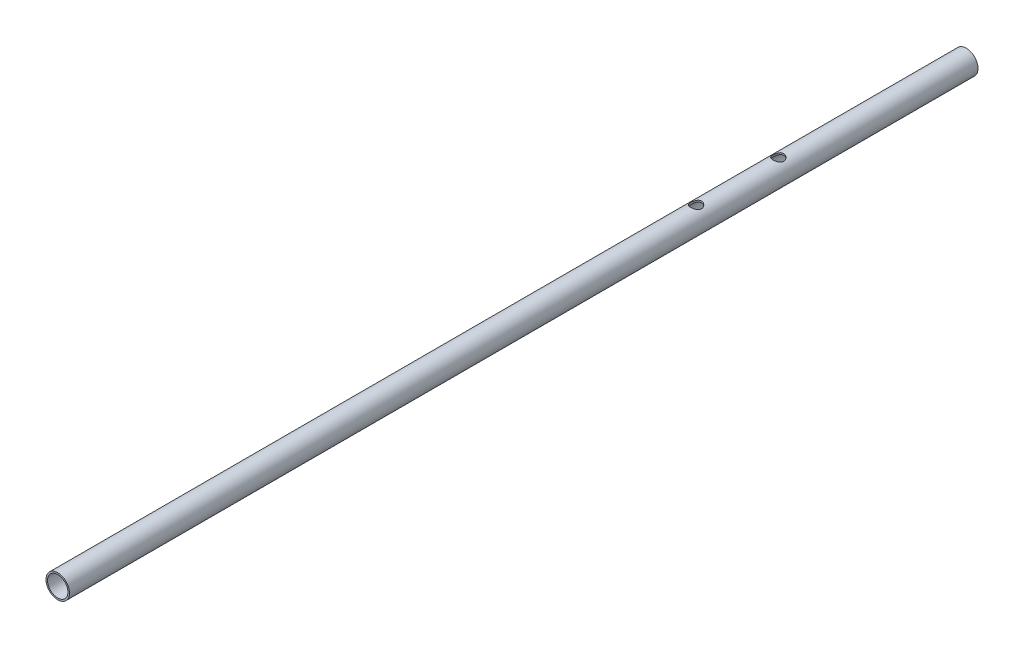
ISO-10303-21;
HEADER;
FILE_DESCRIPTION(('STEP AP214'),'2;1');
FILE_NAME('part.step','',(''),(''),'','','');
FILE_SCHEMA(('AUTOMOTIVE_DESIGN { 1 0 10303 214 1 1 1 1 }'));
ENDSEC;
DATA;
#1=APPLICATION_CONTEXT('core data for automotive mechanical design processes');
#2=APPLICATION_PROTOCOL_DEFINITION('international standard','automotive_design',2000,#1);
#3=PRODUCT_CONTEXT('',#1,'mechanical');
#4=PRODUCT('Part','Part','',(#3));
#5=PRODUCT_RELATED_PRODUCT_CATEGORY('part','',(#4));
#6=PRODUCT_DEFINITION_FORMATION('','',#4);
#7=PRODUCT_DEFINITION_CONTEXT('part definition',#1,'design');
#8=PRODUCT_DEFINITION('design','',#6,#7);
#9=PRODUCT_DEFINITION_SHAPE('','',#8);
#10=(LENGTH_UNIT() NAMED_UNIT(*) SI_UNIT(.MILLI.,.METRE.));
#11=(NAMED_UNIT(*) PLANE_ANGLE_UNIT() SI_UNIT($,.RADIAN.));
#12=(NAMED_UNIT(*) SI_UNIT($,.STERADIAN.) SOLID_ANGLE_UNIT());
#13=UNCERTAINTY_MEASURE_WITH_UNIT(LENGTH_MEASURE(1.E-05),#10,'distance_accuracy_value','');
#14=(GEOMETRIC_REPRESENTATION_CONTEXT(3) GLOBAL_UNCERTAINTY_ASSIGNED_CONTEXT((#13)) GLOBAL_UNIT_ASSIGNED_CONTEXT((#10,
#11,#12)) REPRESENTATION_CONTEXT('',''));
#15=CARTESIAN_POINT('',(0.,0.,0.));
#16=DIRECTION('',(0.,0.,1.));
#17=DIRECTION('',(1.,0.,0.));
#18=AXIS2_PLACEMENT_3D('',#15,#16,#17);
#19=CARTESIAN_POINT('',(0.,0.,1160.));
#20=DIRECTION('',(0.,0.,-1.));
#21=DIRECTION('',(-1.,0.,0.));
#22=AXIS2_PLACEMENT_3D('',#19,#20,#21);
#23=CYLINDRICAL_SURFACE('',#22,13.);
#24=CARTESIAN_POINT('',(0.,-13.,349.25));
#25=CARTESIAN_POINT('',(0.232144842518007,-13.0000000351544,349.250000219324));
#26=CARTESIAN_POINT('',(0.464290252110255,-12.9937240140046,349.230917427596));
#27=CARTESIAN_POINT('',(0.921758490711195,-12.9693048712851,349.155313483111));
#28=CARTESIAN_POINT('',(1.14708034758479,-12.9511600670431,349.098787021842));
#29=CARTESIAN_POINT('',(1.5842398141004,-12.9049782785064,348.950429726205));
#30=CARTESIAN_POINT('',(1.79609879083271,-12.8769574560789,348.858656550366));
#31=CARTESIAN_POINT('',(2.20141901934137,-12.8138940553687,348.642666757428));
#32=CARTESIAN_POINT('',(2.39487685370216,-12.7788501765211,348.518444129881));
#33=CARTESIAN_POINT('',(2.76437773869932,-12.704126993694,348.236712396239));
#34=CARTESIAN_POINT('',(2.9397194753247,-12.6643397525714,348.078312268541));
#35=CARTESIAN_POINT('',(3.26188122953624,-12.5852176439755,347.73461717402));
#36=CARTESIAN_POINT('',(3.40869528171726,-12.5458828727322,347.549316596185));
#37=CARTESIAN_POINT('',(3.67357404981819,-12.4709410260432,347.150843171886));
#38=CARTESIAN_POINT('',(3.79073830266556,-12.4354660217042,346.937044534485));
#39=CARTESIAN_POINT('',(3.98715086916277,-12.373895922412,346.49143035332));
#40=CARTESIAN_POINT('',(4.06641025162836,-12.3477980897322,346.259620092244));
#41=CARTESIAN_POINT('',(4.18215251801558,-12.3090714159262,345.792519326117));
#42=CARTESIAN_POINT('',(4.21994547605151,-12.296031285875,345.557588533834));
#43=CARTESIAN_POINT('',(4.25577680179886,-12.2836784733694,345.08438645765));
#44=CARTESIAN_POINT('',(4.25382690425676,-12.2843617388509,344.846116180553));
#45=CARTESIAN_POINT('',(4.21124738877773,-12.2990172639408,344.38406458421));
#46=CARTESIAN_POINT('',(4.17231329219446,-12.3124069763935,344.16010536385));
#47=CARTESIAN_POINT('',(4.05963122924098,-12.3500156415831,343.722091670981));
#48=CARTESIAN_POINT('',(3.98587924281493,-12.3742358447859,343.508038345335));
#49=CARTESIAN_POINT('',(3.80451789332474,-12.431201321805,343.092002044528));
#50=CARTESIAN_POINT('',(3.6963967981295,-12.4640740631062,342.890260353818));
#51=CARTESIAN_POINT('',(3.44972165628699,-12.5345857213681,342.507241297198));
#52=CARTESIAN_POINT('',(3.31115909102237,-12.5722259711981,342.325969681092));
#53=CARTESIAN_POINT('',(2.99933559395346,-12.6503376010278,341.979490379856));
#54=CARTESIAN_POINT('',(2.8246841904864,-12.6908563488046,341.815542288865));
#55=CARTESIAN_POINT('',(2.44986572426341,-12.7685058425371,341.518940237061));
#56=CARTESIAN_POINT('',(2.24969639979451,-12.8056362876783,341.386289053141));
#57=CARTESIAN_POINT('',(1.82692950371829,-12.872781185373,341.155083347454));
#58=CARTESIAN_POINT('',(1.60414207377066,-12.902726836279,341.056854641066));
#59=CARTESIAN_POINT('',(1.14399406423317,-12.951629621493,340.899654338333));
#60=CARTESIAN_POINT('',(0.906638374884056,-12.9705904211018,340.840669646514));
#61=CARTESIAN_POINT('',(0.434763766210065,-12.9947853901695,340.765836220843));
#62=CARTESIAN_POINT('',(0.200542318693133,-13.0005611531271,340.748284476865));
#63=CARTESIAN_POINT('',(-0.267538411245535,-12.9993525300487,340.751979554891));
#64=CARTESIAN_POINT('',(-0.501397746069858,-12.9923702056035,340.773220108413));
#65=CARTESIAN_POINT('',(-0.955377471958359,-12.9667870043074,340.85254284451));
#66=CARTESIAN_POINT('',(-1.1756989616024,-12.9485128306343,340.909589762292));
#67=CARTESIAN_POINT('',(-1.60356390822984,-12.9025161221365,341.057621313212));
#68=CARTESIAN_POINT('',(-1.81110574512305,-12.8747923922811,341.148610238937));
#69=CARTESIAN_POINT('',(-2.21346935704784,-12.8118349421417,341.364546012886));
#70=CARTESIAN_POINT('',(-2.40782634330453,-12.7764263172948,341.490306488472));
#71=CARTESIAN_POINT('',(-2.77323773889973,-12.7021249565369,341.771253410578));
#72=CARTESIAN_POINT('',(-2.9442852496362,-12.6632311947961,341.926448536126));
#73=CARTESIAN_POINT('',(-3.26597928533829,-12.5841977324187,342.269870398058));
#74=CARTESIAN_POINT('',(-3.41541080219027,-12.5440776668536,342.459242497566));
#75=CARTESIAN_POINT('',(-3.68051179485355,-12.4688766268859,342.861240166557));
#76=CARTESIAN_POINT('',(-3.79618127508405,-12.4337956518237,343.073865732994));
#77=CARTESIAN_POINT('',(-3.98987365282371,-12.3730047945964,343.516244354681));
#78=CARTESIAN_POINT('',(-4.06799703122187,-12.3472699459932,343.745949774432));
#79=CARTESIAN_POINT('',(-4.18412462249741,-12.3084086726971,344.216284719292));
#80=CARTESIAN_POINT('',(-4.22214600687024,-12.2952768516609,344.456909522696));
#81=CARTESIAN_POINT('',(-4.25568336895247,-12.2837062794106,344.929452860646));
#82=CARTESIAN_POINT('',(-4.25320847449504,-12.2845729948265,345.161213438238));
#83=CARTESIAN_POINT('',(-4.21073855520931,-12.2991940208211,345.620835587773));
#84=CARTESIAN_POINT('',(-4.17074560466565,-12.3129476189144,345.848697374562));
#85=CARTESIAN_POINT('',(-4.05577354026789,-12.3512853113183,346.2900868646));
#86=CARTESIAN_POINT('',(-3.98142120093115,-12.3756749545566,346.503796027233));
#87=CARTESIAN_POINT('',(-3.80034385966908,-12.4324715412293,346.915872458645));
#88=CARTESIAN_POINT('',(-3.69361185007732,-12.4648802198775,347.114236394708));
#89=CARTESIAN_POINT('',(-3.44553948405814,-12.5357706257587,347.499071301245));
#90=CARTESIAN_POINT('',(-3.30292751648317,-12.5744510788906,347.684685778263));
#91=CARTESIAN_POINT('',(-2.98932056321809,-12.652669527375,348.029998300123));
#92=CARTESIAN_POINT('',(-2.81831769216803,-12.6922077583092,348.189689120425));
#93=CARTESIAN_POINT('',(-2.44519208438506,-12.7694400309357,348.484555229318));
#94=CARTESIAN_POINT('',(-2.24215305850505,-12.807011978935,348.618606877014));
#95=CARTESIAN_POINT('',(-1.81520436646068,-12.8744570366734,348.850519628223));
#96=CARTESIAN_POINT('',(-1.59130098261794,-12.9043324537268,348.948391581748));
#97=CARTESIAN_POINT('',(-1.1421849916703,-12.9515804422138,349.100102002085));
#98=CARTESIAN_POINT('',(-0.917780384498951,-12.9695706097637,349.156139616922));
#99=CARTESIAN_POINT('',(-0.462249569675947,-12.9937788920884,349.23108384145));
#100=CARTESIAN_POINT('',(-0.231125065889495,-12.999999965,349.249999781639));
#101=CARTESIAN_POINT('',(0.,-13.,349.25));
#102=B_SPLINE_CURVE_WITH_KNOTS('',3,(#24,#25,#26,#27,#28,#29,#30,#31,#32,#33,#34,#35,#36,#37,
#38,#39,#40,#41,#42,#43,#44,#45,#46,#47,#48,#49,#50,#51,#52,#53,#54,#55,#56,#57,#58,#59,#60,#61,
#62,#63,#64,#65,#66,#67,#68,#69,#70,#71,#72,#73,#74,#75,#76,#77,#78,#79,#80,#81,#82,#83,#84,#85,
#86,#87,#88,#89,#90,#91,#92,#93,#94,#95,#96,#97,#98,#99,#100,#101),.UNSPECIFIED.,.T.,.F.,(4,2,2,
2,2,2,2,2,2,2,2,2,2,2,2,2,2,2,2,2,2,2,2,2,2,2,2,2,2,2,2,2,2,2,2,2,2,2,4),(0.,0.69558431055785,
1.3912672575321,2.08581698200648,2.78049544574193,3.49612803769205,4.21191011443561,
4.9473534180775,5.68258182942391,6.39384582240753,7.10489980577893,7.78485338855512,
8.46488549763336,9.15555855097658,9.84642512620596,10.5719000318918,11.2974392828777,
12.0296713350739,12.7616589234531,13.4629921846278,14.1642121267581,14.8460367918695,
15.5279477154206,16.2274071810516,16.9270732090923,17.6572520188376,18.3874307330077,
19.115644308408,19.8435459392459,20.5354489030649,21.2273136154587,21.9070275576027,
22.5868887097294,23.2954721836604,24.0042527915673,24.7392182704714,25.4739631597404,
26.166666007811,26.8591947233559),.UNSPECIFIED.);
#103=CARTESIAN_POINT('',(0.,-13.,349.25));
#104=VERTEX_POINT('',#103);
#105=EDGE_CURVE('E104',#104,#104,#102,.T.);
#106=ORIENTED_EDGE('',*,*,#105,.F.);
#107=EDGE_LOOP('',(#106));
#108=FACE_BOUND('',#107,.T.);
#109=CARTESIAN_POINT('',(0.,-13.,244.25));
#110=CARTESIAN_POINT('',(0.232144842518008,-13.0000000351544,244.250000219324));
#111=CARTESIAN_POINT('',(0.464290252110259,-12.9937240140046,244.230917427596));
#112=CARTESIAN_POINT('',(0.921758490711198,-12.9693048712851,244.155313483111));
#113=CARTESIAN_POINT('',(1.14708034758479,-12.9511600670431,244.098787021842));
#114=CARTESIAN_POINT('',(1.58423981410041,-12.9049782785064,243.950429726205));
#115=CARTESIAN_POINT('',(1.79609879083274,-12.8769574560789,243.858656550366));
#116=CARTESIAN_POINT('',(2.20141901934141,-12.8138940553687,243.642666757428));
#117=CARTESIAN_POINT('',(2.39487685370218,-12.7788501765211,243.518444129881));
#118=CARTESIAN_POINT('',(2.76437773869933,-12.704126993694,243.236712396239));
#119=CARTESIAN_POINT('',(2.93971947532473,-12.6643397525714,243.078312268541));
#120=CARTESIAN_POINT('',(3.26188122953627,-12.5852176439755,242.73461717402));
#121=CARTESIAN_POINT('',(3.40869528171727,-12.5458828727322,242.549316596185));
#122=CARTESIAN_POINT('',(3.67357404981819,-12.4709410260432,242.150843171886));
#123=CARTESIAN_POINT('',(3.79073830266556,-12.4354660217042,241.937044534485));
#124=CARTESIAN_POINT('',(3.98715086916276,-12.373895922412,241.49143035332));
#125=CARTESIAN_POINT('',(4.06641025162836,-12.3477980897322,241.259620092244));
#126=CARTESIAN_POINT('',(4.18215251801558,-12.3090714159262,240.792519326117));
#127=CARTESIAN_POINT('',(4.21994547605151,-12.296031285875,240.557588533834));
#128=CARTESIAN_POINT('',(4.25577680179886,-12.2836784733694,240.08438645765));
#129=CARTESIAN_POINT('',(4.25382690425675,-12.2843617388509,239.846116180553));
#130=CARTESIAN_POINT('',(4.21124738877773,-12.2990172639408,239.38406458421));
#131=CARTESIAN_POINT('',(4.17231329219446,-12.3124069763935,239.16010536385));
#132=CARTESIAN_POINT('',(4.05963122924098,-12.3500156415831,238.722091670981));
#133=CARTESIAN_POINT('',(3.98587924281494,-12.3742358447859,238.508038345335));
#134=CARTESIAN_POINT('',(3.80451789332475,-12.431201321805,238.092002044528));
#135=CARTESIAN_POINT('',(3.6963967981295,-12.4640740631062,237.890260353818));
#136=CARTESIAN_POINT('',(3.44972165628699,-12.5345857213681,237.507241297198));
#137=CARTESIAN_POINT('',(3.31115909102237,-12.5722259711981,237.325969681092));
#138=CARTESIAN_POINT('',(2.99933559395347,-12.6503376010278,236.979490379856));
#139=CARTESIAN_POINT('',(2.82468419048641,-12.6908563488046,236.815542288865));
#140=CARTESIAN_POINT('',(2.44986572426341,-12.7685058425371,236.518940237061));
#141=CARTESIAN_POINT('',(2.24969639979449,-12.8056362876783,236.386289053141));
#142=CARTESIAN_POINT('',(1.82692950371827,-12.872781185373,236.155083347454));
#143=CARTESIAN_POINT('',(1.60414207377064,-12.902726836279,236.056854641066));
#144=CARTESIAN_POINT('',(1.14399406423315,-12.951629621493,235.899654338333));
#145=CARTESIAN_POINT('',(0.906638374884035,-12.9705904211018,235.840669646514));
#146=CARTESIAN_POINT('',(0.434763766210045,-12.9947853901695,235.765836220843));
#147=CARTESIAN_POINT('',(0.200542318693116,-13.0005611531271,235.748284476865));
#148=CARTESIAN_POINT('',(-0.267538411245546,-12.9993525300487,235.751979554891));
#149=CARTESIAN_POINT('',(-0.501397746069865,-12.9923702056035,235.773220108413));
#150=CARTESIAN_POINT('',(-0.955377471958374,-12.9667870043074,235.85254284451));
#151=CARTESIAN_POINT('',(-1.17569896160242,-12.9485128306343,235.909589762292));
#152=CARTESIAN_POINT('',(-1.60356390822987,-12.9025161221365,236.057621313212));
#153=CARTESIAN_POINT('',(-1.81110574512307,-12.8747923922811,236.148610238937));
#154=CARTESIAN_POINT('',(-2.21346935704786,-12.8118349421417,236.364546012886));
#155=CARTESIAN_POINT('',(-2.40782634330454,-12.7764263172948,236.490306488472));
#156=CARTESIAN_POINT('',(-2.77323773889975,-12.7021249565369,236.771253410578));
#157=CARTESIAN_POINT('',(-2.94428524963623,-12.6632311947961,236.926448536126));
#158=CARTESIAN_POINT('',(-3.26597928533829,-12.5841977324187,237.269870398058));
#159=CARTESIAN_POINT('',(-3.41541080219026,-12.5440776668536,237.459242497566));
#160=CARTESIAN_POINT('',(-3.68051179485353,-12.4688766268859,237.861240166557));
#161=CARTESIAN_POINT('',(-3.79618127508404,-12.4337956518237,238.073865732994));
#162=CARTESIAN_POINT('',(-3.98987365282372,-12.3730047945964,238.516244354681));
#163=CARTESIAN_POINT('',(-4.06799703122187,-12.3472699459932,238.745949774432));
#164=CARTESIAN_POINT('',(-4.1841246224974,-12.3084086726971,239.216284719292));
#165=CARTESIAN_POINT('',(-4.22214600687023,-12.2952768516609,239.456909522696));
#166=CARTESIAN_POINT('',(-4.25568336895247,-12.2837062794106,239.929452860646));
#167=CARTESIAN_POINT('',(-4.25320847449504,-12.2845729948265,240.161213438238));
#168=CARTESIAN_POINT('',(-4.21073855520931,-12.2991940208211,240.620835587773));
#169=CARTESIAN_POINT('',(-4.17074560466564,-12.3129476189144,240.848697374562));
#170=CARTESIAN_POINT('',(-4.05577354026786,-12.3512853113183,241.2900868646));
#171=CARTESIAN_POINT('',(-3.98142120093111,-12.3756749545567,241.503796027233));
#172=CARTESIAN_POINT('',(-3.80034385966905,-12.4324715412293,241.915872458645));
#173=CARTESIAN_POINT('',(-3.6936118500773,-12.4648802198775,242.114236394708));
#174=CARTESIAN_POINT('',(-3.44553948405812,-12.5357706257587,242.499071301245));
#175=CARTESIAN_POINT('',(-3.30292751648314,-12.5744510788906,242.684685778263));
#176=CARTESIAN_POINT('',(-2.98932056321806,-12.652669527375,243.029998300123));
#177=CARTESIAN_POINT('',(-2.81831769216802,-12.6922077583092,243.189689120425));
#178=CARTESIAN_POINT('',(-2.44519208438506,-12.7694400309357,243.484555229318));
#179=CARTESIAN_POINT('',(-2.24215305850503,-12.8070119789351,243.618606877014));
#180=CARTESIAN_POINT('',(-1.81520436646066,-12.8744570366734,243.850519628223));
#181=CARTESIAN_POINT('',(-1.59130098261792,-12.9043324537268,243.948391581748));
#182=CARTESIAN_POINT('',(-1.14218499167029,-12.9515804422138,244.100102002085));
#183=CARTESIAN_POINT('',(-0.917780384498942,-12.9695706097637,244.156139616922));
#184=CARTESIAN_POINT('',(-0.462249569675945,-12.9937788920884,244.23108384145));
#185=CARTESIAN_POINT('',(-0.231125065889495,-12.999999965,244.249999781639));
#186=CARTESIAN_POINT('',(0.,-13.,244.25));
#187=B_SPLINE_CURVE_WITH_KNOTS('',3,(#109,#110,#111,#112,#113,#114,#115,#116,#117,#118,#119,
#120,#121,#122,#123,#124,#125,#126,#127,#128,#129,#130,#131,#132,#133,#134,#135,#136,#137,#138,
#139,#140,#141,#142,#143,#144,#145,#146,#147,#148,#149,#150,#151,#152,#153,#154,#155,#156,#157,
#158,#159,#160,#161,#162,#163,#164,#165,#166,#167,#168,#169,#170,#171,#172,#173,#174,#175,#176,
#177,#178,#179,#180,#181,#182,#183,#184,#185,#186),.UNSPECIFIED.,.T.,.F.,(4,2,2,2,2,2,2,2,2,2,2,
2,2,2,2,2,2,2,2,2,2,2,2,2,2,2,2,2,2,2,2,2,2,2,2,2,2,2,4),(0.,0.695584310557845,1.39126725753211,
2.08581698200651,2.78049544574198,3.49612803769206,4.21191011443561,4.94735341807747,
5.68258182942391,6.39384582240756,7.1048998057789,7.78485338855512,8.46488549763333,
9.15555855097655,9.84642512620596,10.5719000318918,11.2974392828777,12.0296713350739,
12.7616589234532,13.4629921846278,14.1642121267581,14.8460367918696,15.5279477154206,
16.2274071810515,16.9270732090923,17.6572520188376,18.3874307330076,19.1156443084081,
19.8435459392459,20.5354489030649,21.2273136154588,21.9070275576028,22.5868887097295,
23.2954721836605,24.0042527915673,24.7392182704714,25.4739631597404,26.166666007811,
26.8591947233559),.UNSPECIFIED.);
#188=CARTESIAN_POINT('',(0.,-13.,244.25));
#189=VERTEX_POINT('',#188);
#190=EDGE_CURVE('E108',#189,#189,#187,.T.);
#191=ORIENTED_EDGE('',*,*,#190,.F.);
#192=EDGE_LOOP('',(#191));
#193=FACE_BOUND('',#192,.T.);
#194=CARTESIAN_POINT('',(0.,13.,233.));
#195=CARTESIAN_POINT('',(-0.182338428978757,13.0000009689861,232.999998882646));
#196=CARTESIAN_POINT('',(-0.364663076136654,12.996155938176,233.007131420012));
#197=CARTESIAN_POINT('',(-0.727947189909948,12.9808762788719,233.035569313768));
#198=CARTESIAN_POINT('',(-0.908906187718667,12.969439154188,233.05687933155));
#199=CARTESIAN_POINT('',(-1.26820528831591,12.9392502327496,233.113435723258));
#200=CARTESIAN_POINT('',(-1.44654238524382,12.9204906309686,233.148696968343));
#201=CARTESIAN_POINT('',(-1.7991968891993,12.8761210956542,233.232743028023));
#202=CARTESIAN_POINT('',(-1.97351262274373,12.8505083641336,233.281533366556));
#203=CARTESIAN_POINT('',(-2.3161404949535,12.7931824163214,233.391843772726));
#204=CARTESIAN_POINT('',(-2.48447627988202,12.7614973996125,233.453305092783));
#205=CARTESIAN_POINT('',(-2.81502698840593,12.6926823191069,233.588482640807));
#206=CARTESIAN_POINT('',(-2.97723954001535,12.6555501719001,233.662203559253));
#207=CARTESIAN_POINT('',(-3.45324174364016,12.5372125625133,233.900748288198));
#208=CARTESIAN_POINT('',(-3.75673978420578,12.4490059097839,234.083066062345));
#209=CARTESIAN_POINT('',(-4.34964558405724,12.2549807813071,234.502596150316));
#210=CARTESIAN_POINT('',(-4.63675068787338,12.1483786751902,234.742665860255));
#211=CARTESIAN_POINT('',(-5.1689360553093,11.9316650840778,235.264911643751));
#212=CARTESIAN_POINT('',(-5.41397875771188,11.8215505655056,235.54712493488));
#213=CARTESIAN_POINT('',(-5.75658529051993,11.6567529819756,236.012081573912));
#214=CARTESIAN_POINT('',(-5.87068500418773,11.5995482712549,236.181999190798));
#215=CARTESIAN_POINT('',(-6.08411005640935,11.4890392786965,236.532201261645));
#216=CARTESIAN_POINT('',(-6.18343232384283,11.4357358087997,236.712487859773));
#217=CARTESIAN_POINT('',(-6.366310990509,11.3349458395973,237.082357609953));
#218=CARTESIAN_POINT('',(-6.44987362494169,11.2874570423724,237.27193704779));
#219=CARTESIAN_POINT('',(-6.60028994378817,11.2001669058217,237.659213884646));
#220=CARTESIAN_POINT('',(-6.66715420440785,11.1603607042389,237.85690605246));
#221=CARTESIAN_POINT('',(-6.77965207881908,11.0923563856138,238.246483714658));
#222=CARTESIAN_POINT('',(-6.82635016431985,11.0635889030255,238.437961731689));
#223=CARTESIAN_POINT('',(-6.90356213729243,11.0155756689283,238.825341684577));
#224=CARTESIAN_POINT('',(-6.934076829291,10.9963294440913,239.021243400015));
#225=CARTESIAN_POINT('',(-6.97836686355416,10.9682764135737,239.415455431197));
#226=CARTESIAN_POINT('',(-6.99216101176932,10.9594578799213,239.613762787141));
#227=CARTESIAN_POINT('',(-7.00280959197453,10.9526574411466,240.011006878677));
#228=CARTESIAN_POINT('',(-6.99966615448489,10.9546741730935,240.209943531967));
#229=CARTESIAN_POINT('',(-6.97818766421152,10.9683642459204,240.577724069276));
#230=CARTESIAN_POINT('',(-6.96211481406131,10.9785992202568,240.746760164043));
#231=CARTESIAN_POINT('',(-6.91784196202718,11.0065503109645,241.082665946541));
#232=CARTESIAN_POINT('',(-6.88963805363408,11.0242688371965,241.249534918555));
#233=CARTESIAN_POINT('',(-6.82145512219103,11.0665872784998,241.579939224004));
#234=CARTESIAN_POINT('',(-6.78147665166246,11.0911868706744,241.743474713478));
#235=CARTESIAN_POINT('',(-6.69017036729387,11.146500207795,242.066345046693));
#236=CARTESIAN_POINT('',(-6.63883797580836,11.1772164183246,242.225678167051));
#237=CARTESIAN_POINT('',(-6.52408149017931,11.2445933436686,242.542714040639));
#238=CARTESIAN_POINT('',(-6.46041852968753,11.2813688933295,242.700305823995));
#239=CARTESIAN_POINT('',(-6.32228060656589,11.3593599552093,243.009563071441));
#240=CARTESIAN_POINT('',(-6.24780208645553,11.4005769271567,243.16122656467));
#241=CARTESIAN_POINT('',(-6.0089245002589,11.5293343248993,243.606414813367));
#242=CARTESIAN_POINT('',(-5.82903205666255,11.6220126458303,243.890277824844));
#243=CARTESIAN_POINT('',(-5.40171671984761,11.8273226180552,244.468717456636));
#244=CARTESIAN_POINT('',(-5.14820890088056,11.9408602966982,244.758498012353));
#245=CARTESIAN_POINT('',(-4.73452578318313,12.1081185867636,245.15957877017));
#246=CARTESIAN_POINT('',(-4.59095172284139,12.16340000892,245.287750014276));
#247=CARTESIAN_POINT('',(-4.29314973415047,12.271671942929,245.532265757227));
#248=CARTESIAN_POINT('',(-4.13892028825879,12.3246621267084,245.648608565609));
#249=CARTESIAN_POINT('',(-3.81064255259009,12.4302274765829,245.875479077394));
#250=CARTESIAN_POINT('',(-3.63595822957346,12.4825719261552,245.985195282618));
#251=CARTESIAN_POINT('',(-3.2764541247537,12.5817165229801,246.189309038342));
#252=CARTESIAN_POINT('',(-3.09163901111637,12.6285191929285,246.283713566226));
#253=CARTESIAN_POINT('',(-2.71307809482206,12.7152228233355,246.456194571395));
#254=CARTESIAN_POINT('',(-2.51933650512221,12.7551269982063,246.534278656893));
#255=CARTESIAN_POINT('',(-2.12430595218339,12.8268311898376,246.673165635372));
#256=CARTESIAN_POINT('',(-1.92301801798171,12.8586323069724,246.733970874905));
#257=CARTESIAN_POINT('',(-1.53319683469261,12.9106309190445,246.832714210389));
#258=CARTESIAN_POINT('',(-1.34516760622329,12.9316204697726,246.872228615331));
#259=CARTESIAN_POINT('',(-0.965779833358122,12.9654743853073,246.935722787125));
#260=CARTESIAN_POINT('',(-0.774421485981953,12.9783392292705,246.959703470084));
#261=CARTESIAN_POINT('',(-0.390092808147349,12.9955689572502,246.991780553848));
#262=CARTESIAN_POINT('',(-0.197123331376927,12.9999380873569,246.999884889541));
#263=CARTESIAN_POINT('',(0.18882258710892,13.0000605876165,247.000112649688));
#264=CARTESIAN_POINT('',(0.381799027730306,12.9958144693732,246.992237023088));
#265=CARTESIAN_POINT('',(0.748145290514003,12.9796266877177,246.96210087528));
#266=CARTESIAN_POINT('',(0.921666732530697,12.968438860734,246.941248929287));
#267=CARTESIAN_POINT('',(1.2661750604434,12.9393466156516,246.886742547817));
#268=CARTESIAN_POINT('',(1.43716107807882,12.9214399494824,246.85308382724));
#269=CARTESIAN_POINT('',(1.77535341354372,12.8793304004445,246.773351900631));
#270=CARTESIAN_POINT('',(1.94256095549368,12.8551295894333,246.72728277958));
#271=CARTESIAN_POINT('',(2.27231079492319,12.8009585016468,246.623179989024));
#272=CARTESIAN_POINT('',(2.43485124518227,12.7709859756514,246.565141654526));
#273=CARTESIAN_POINT('',(2.75813107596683,12.7051391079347,246.436125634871));
#274=CARTESIAN_POINT('',(2.91873554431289,12.6691412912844,246.364872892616));
#275=CARTESIAN_POINT('',(3.23328714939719,12.5925414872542,246.211001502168));
#276=CARTESIAN_POINT('',(3.38723201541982,12.551937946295,246.128379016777));
#277=CARTESIAN_POINT('',(3.83796726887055,12.4244640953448,245.864398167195));
#278=CARTESIAN_POINT('',(4.12383756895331,12.3318926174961,245.666854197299));
#279=CARTESIAN_POINT('',(4.69107520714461,12.1282442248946,245.209668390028));
#280=CARTESIAN_POINT('',(4.96855347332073,12.0162501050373,244.945604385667));
#281=CARTESIAN_POINT('',(5.34986264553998,11.8489816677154,244.518353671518));
#282=CARTESIAN_POINT('',(5.47123366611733,11.7933001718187,244.370609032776));
#283=CARTESIAN_POINT('',(5.70179784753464,11.683568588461,244.065229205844));
#284=CARTESIAN_POINT('',(5.8109889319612,11.6295187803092,243.907592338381));
#285=CARTESIAN_POINT('',(6.02376529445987,11.5208302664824,243.571630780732));
#286=CARTESIAN_POINT('',(6.12640504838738,11.4664212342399,243.392631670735));
#287=CARTESIAN_POINT('',(6.31598131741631,11.3630996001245,243.025079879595));
#288=CARTESIAN_POINT('',(6.40292538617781,11.3141843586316,242.836531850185));
#289=CARTESIAN_POINT('',(6.56014286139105,11.2237583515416,242.451082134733));
#290=CARTESIAN_POINT('',(6.63043134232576,11.1822408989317,242.254188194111));
#291=CARTESIAN_POINT('',(6.75345383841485,11.1083763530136,241.853319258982));
#292=CARTESIAN_POINT('',(6.80619103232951,11.0760275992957,241.649345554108));
#293=CARTESIAN_POINT('',(6.88897522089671,11.024706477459,241.256312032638));
#294=CARTESIAN_POINT('',(6.92073619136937,11.0047357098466,241.067743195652));
#295=CARTESIAN_POINT('',(6.96874964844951,10.9743949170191,240.687871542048));
#296=CARTESIAN_POINT('',(6.98500326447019,10.9640241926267,240.496568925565));
#297=CARTESIAN_POINT('',(7.00171502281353,10.9533595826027,240.113112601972));
#298=CARTESIAN_POINT('',(7.00218299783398,10.9530594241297,239.920959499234));
#299=CARTESIAN_POINT('',(6.98734028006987,10.9625340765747,239.537525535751));
#300=CARTESIAN_POINT('',(6.97203070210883,10.9723081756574,239.346244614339));
#301=CARTESIAN_POINT('',(6.92881942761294,10.9996371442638,238.990340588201));
#302=CARTESIAN_POINT('',(6.90275322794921,11.0160528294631,238.825403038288));
#303=CARTESIAN_POINT('',(6.83911315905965,11.0556736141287,238.498572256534));
#304=CARTESIAN_POINT('',(6.80153556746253,11.0788809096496,238.33668002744));
#305=CARTESIAN_POINT('',(6.6721269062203,11.1576451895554,237.857056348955));
#306=CARTESIAN_POINT('',(6.56359434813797,11.2223617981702,237.54517198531));
#307=CARTESIAN_POINT('',(6.29769250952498,11.3738185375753,236.924207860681));
#308=CARTESIAN_POINT('',(6.13765665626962,11.4616974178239,236.616567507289));
#309=CARTESIAN_POINT('',(5.77591944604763,11.6481858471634,236.030425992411));
#310=CARTESIAN_POINT('',(5.5741956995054,11.7468011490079,235.751940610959));
#311=CARTESIAN_POINT('',(5.09971349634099,11.9611907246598,235.188799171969));
#312=CARTESIAN_POINT('',(4.8208563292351,12.0773400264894,234.909357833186));
#313=CARTESIAN_POINT('',(4.36908361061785,12.2448805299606,234.527327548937));
#314=CARTESIAN_POINT('',(4.2127828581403,12.2996516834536,234.406096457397));
#315=CARTESIAN_POINT('',(3.88959578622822,12.4056404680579,234.176747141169));
#316=CARTESIAN_POINT('',(3.72270821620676,12.4568576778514,234.068630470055));
#317=CARTESIAN_POINT('',(3.37449490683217,12.5557338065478,233.863654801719));
#318=CARTESIAN_POINT('',(3.19289724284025,12.6032548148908,233.767190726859));
#319=CARTESIAN_POINT('',(2.8206795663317,12.6917425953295,233.590147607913));
#320=CARTESIAN_POINT('',(2.6300640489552,12.7327125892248,233.50956075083));
#321=CARTESIAN_POINT('',(2.24148160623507,12.8068262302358,233.365347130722));
#322=CARTESIAN_POINT('',(2.04353015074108,12.8399853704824,233.301686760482));
#323=CARTESIAN_POINT('',(1.64164692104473,12.8975255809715,233.192038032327));
#324=CARTESIAN_POINT('',(1.43771847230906,12.9219114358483,233.146040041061));
#325=CARTESIAN_POINT('',(1.02914468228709,12.9607970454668,233.073009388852));
#326=CARTESIAN_POINT('',(0.824569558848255,12.9754567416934,233.045669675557));
#327=CARTESIAN_POINT('',(0.413323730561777,12.9950576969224,233.009165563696));
#328=CARTESIAN_POINT('',(0.206653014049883,12.9999989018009,233.000001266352));
#329=CARTESIAN_POINT('',(0.,13.,233.));
#330=B_SPLINE_CURVE_WITH_KNOTS('',3,(#194,#195,#196,#197,#198,#199,#200,#201,#202,#203,#204,
#205,#206,#207,#208,#209,#210,#211,#212,#213,#214,#215,#216,#217,#218,#219,#220,#221,#222,#223,
#224,#225,#226,#227,#228,#229,#230,#231,#232,#233,#234,#235,#236,#237,#238,#239,#240,#241,#242,
#243,#244,#245,#246,#247,#248,#249,#250,#251,#252,#253,#254,#255,#256,#257,#258,#259,#260,#261,
#262,#263,#264,#265,#266,#267,#268,#269,#270,#271,#272,#273,#274,#275,#276,#277,#278,#279,#280,
#281,#282,#283,#284,#285,#286,#287,#288,#289,#290,#291,#292,#293,#294,#295,#296,#297,#298,#299,
#300,#301,#302,#303,#304,#305,#306,#307,#308,#309,#310,#311,#312,#313,#314,#315,#316,#317,#318,
#319,#320,#321,#322,#323,#324,#325,#326,#327,#328,#329),.UNSPECIFIED.,.T.,.F.,(4,2,2,2,2,2,2,2,
2,2,2,2,2,2,2,2,2,2,2,2,2,2,2,2,2,2,2,2,2,2,2,2,2,2,2,2,2,2,2,2,2,2,2,2,2,2,2,2,2,2,2,2,2,2,2,2,
2,2,2,2,2,2,2,2,2,2,2,4),(0.,0.546812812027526,1.09380549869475,1.64138282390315,
2.1891840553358,2.73450039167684,3.28002584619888,4.36998952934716,5.53290519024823,
6.69685397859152,7.33373588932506,7.97074997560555,8.60751150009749,9.24386869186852,
9.84051557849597,10.4371328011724,11.0330783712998,11.6289489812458,12.1386652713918,
12.6485458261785,13.1584024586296,13.6684650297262,14.189629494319,14.71096577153,
15.7531843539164,16.9519621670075,17.5521711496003,18.1524657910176,18.7900894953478,
19.4274218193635,20.0644563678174,20.7014043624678,21.2804479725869,21.8594574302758,
22.4381774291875,23.0168630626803,23.5416336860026,24.0665800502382,24.5913538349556,
25.1163325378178,25.6538044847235,26.1914582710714,27.2661812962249,28.4580784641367,
29.055016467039,29.6520560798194,30.2914028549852,30.9304411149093,31.5688987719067,
32.2072407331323,32.7831890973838,33.3590955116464,33.9346431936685,34.5101502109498,
35.0129392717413,35.5158910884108,36.5211773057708,37.5903873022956,38.6601730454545,
39.8886798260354,40.50384857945,41.1190901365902,41.7513784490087,42.3833548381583,
43.0140669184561,43.6444345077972,44.2641606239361,44.8838901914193),.UNSPECIFIED.);
#331=CARTESIAN_POINT('',(0.,13.,233.));
#332=VERTEX_POINT('',#331);
#333=EDGE_CURVE('E55',#332,#332,#330,.T.);
#334=ORIENTED_EDGE('',*,*,#333,.T.);
#335=EDGE_LOOP('',(#334));
#336=FACE_BOUND('',#335,.T.);
#337=CARTESIAN_POINT('',(0.,0.,1160.));
#338=DIRECTION('',(0.,0.,1.));
#339=DIRECTION('',(1.,0.,0.));
#340=AXIS2_PLACEMENT_3D('',#337,#338,#339);
#341=CIRCLE('',#340,13.);
#342=CARTESIAN_POINT('',(13.,0.,1160.));
#343=VERTEX_POINT('',#342);
#344=EDGE_CURVE('E45',#343,#343,#341,.T.);
#345=ORIENTED_EDGE('',*,*,#344,.T.);
#346=EDGE_LOOP('',(#345));
#347=FACE_BOUND('',#346,.T.);
#348=CARTESIAN_POINT('',(0.,0.,0.));
#349=DIRECTION('',(0.,0.,1.));
#350=DIRECTION('',(1.,0.,0.));
#351=AXIS2_PLACEMENT_3D('',#348,#349,#350);
#352=CIRCLE('',#351,13.);
#353=CARTESIAN_POINT('',(13.,0.,0.));
#354=VERTEX_POINT('',#353);
#355=EDGE_CURVE('E79',#354,#354,#352,.T.);
#356=ORIENTED_EDGE('',*,*,#355,.F.);
#357=EDGE_LOOP('',(#356));
#358=FACE_BOUND('',#357,.T.);
#359=CARTESIAN_POINT('',(0.,13.,338.));
#360=CARTESIAN_POINT('',(-0.182338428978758,13.0000009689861,337.999998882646));
#361=CARTESIAN_POINT('',(-0.364663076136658,12.996155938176,338.007131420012));
#362=CARTESIAN_POINT('',(-0.727947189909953,12.9808762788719,338.035569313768));
#363=CARTESIAN_POINT('',(-0.908906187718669,12.969439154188,338.05687933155));
#364=CARTESIAN_POINT('',(-1.26820528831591,12.9392502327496,338.113435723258));
#365=CARTESIAN_POINT('',(-1.44654238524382,12.9204906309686,338.148696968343));
#366=CARTESIAN_POINT('',(-1.7991968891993,12.8761210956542,338.232743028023));
#367=CARTESIAN_POINT('',(-1.97351262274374,12.8505083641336,338.281533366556));
#368=CARTESIAN_POINT('',(-2.3161404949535,12.7931824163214,338.391843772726));
#369=CARTESIAN_POINT('',(-2.48447627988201,12.7614973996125,338.453305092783));
#370=CARTESIAN_POINT('',(-2.81502698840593,12.6926823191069,338.588482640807));
#371=CARTESIAN_POINT('',(-2.97723954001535,12.6555501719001,338.662203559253));
#372=CARTESIAN_POINT('',(-3.45324174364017,12.5372125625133,338.900748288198));
#373=CARTESIAN_POINT('',(-3.75673978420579,12.4490059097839,339.083066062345));
#374=CARTESIAN_POINT('',(-4.34964558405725,12.2549807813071,339.502596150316));
#375=CARTESIAN_POINT('',(-4.63675068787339,12.1483786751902,339.742665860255));
#376=CARTESIAN_POINT('',(-5.1689360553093,11.9316650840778,340.264911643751));
#377=CARTESIAN_POINT('',(-5.41397875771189,11.8215505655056,340.54712493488));
#378=CARTESIAN_POINT('',(-5.75658529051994,11.6567529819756,341.012081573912));
#379=CARTESIAN_POINT('',(-5.87068500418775,11.5995482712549,341.181999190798));
#380=CARTESIAN_POINT('',(-6.08411005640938,11.4890392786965,341.532201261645));
#381=CARTESIAN_POINT('',(-6.18343232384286,11.4357358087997,341.712487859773));
#382=CARTESIAN_POINT('',(-6.36631099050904,11.3349458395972,342.082357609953));
#383=CARTESIAN_POINT('',(-6.44987362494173,11.2874570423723,342.27193704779));
#384=CARTESIAN_POINT('',(-6.6002899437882,11.2001669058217,342.659213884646));
#385=CARTESIAN_POINT('',(-6.66715420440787,11.1603607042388,342.85690605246));
#386=CARTESIAN_POINT('',(-6.77965207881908,11.0923563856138,343.246483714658));
#387=CARTESIAN_POINT('',(-6.82635016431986,11.0635889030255,343.437961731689));
#388=CARTESIAN_POINT('',(-6.90356213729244,11.0155756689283,343.825341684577));
#389=CARTESIAN_POINT('',(-6.93407682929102,10.9963294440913,344.021243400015));
#390=CARTESIAN_POINT('',(-6.97836686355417,10.9682764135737,344.415455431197));
#391=CARTESIAN_POINT('',(-6.99216101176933,10.9594578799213,344.613762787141));
#392=CARTESIAN_POINT('',(-7.00280959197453,10.9526574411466,345.011006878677));
#393=CARTESIAN_POINT('',(-6.99966615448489,10.9546741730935,345.209943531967));
#394=CARTESIAN_POINT('',(-6.97818766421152,10.9683642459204,345.577724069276));
#395=CARTESIAN_POINT('',(-6.9621148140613,10.9785992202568,345.746760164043));
#396=CARTESIAN_POINT('',(-6.91784196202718,11.0065503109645,346.082665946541));
#397=CARTESIAN_POINT('',(-6.88963805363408,11.0242688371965,346.249534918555));
#398=CARTESIAN_POINT('',(-6.82145512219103,11.0665872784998,346.579939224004));
#399=CARTESIAN_POINT('',(-6.78147665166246,11.0911868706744,346.743474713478));
#400=CARTESIAN_POINT('',(-6.69017036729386,11.146500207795,347.066345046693));
#401=CARTESIAN_POINT('',(-6.63883797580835,11.1772164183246,347.225678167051));
#402=CARTESIAN_POINT('',(-6.52408149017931,11.2445933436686,347.542714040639));
#403=CARTESIAN_POINT('',(-6.46041852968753,11.2813688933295,347.700305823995));
#404=CARTESIAN_POINT('',(-6.32228060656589,11.3593599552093,348.009563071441));
#405=CARTESIAN_POINT('',(-6.24780208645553,11.4005769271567,348.16122656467));
#406=CARTESIAN_POINT('',(-6.00892450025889,11.5293343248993,348.606414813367));
#407=CARTESIAN_POINT('',(-5.82903205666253,11.6220126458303,348.890277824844));
#408=CARTESIAN_POINT('',(-5.40171671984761,11.8273226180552,349.468717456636));
#409=CARTESIAN_POINT('',(-5.1482089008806,11.9408602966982,349.758498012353));
#410=CARTESIAN_POINT('',(-4.73452578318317,12.1081185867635,350.15957877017));
#411=CARTESIAN_POINT('',(-4.59095172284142,12.16340000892,350.287750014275));
#412=CARTESIAN_POINT('',(-4.2931497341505,12.271671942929,350.532265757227));
#413=CARTESIAN_POINT('',(-4.13892028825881,12.3246621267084,350.648608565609));
#414=CARTESIAN_POINT('',(-3.81064255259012,12.4302274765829,350.875479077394));
#415=CARTESIAN_POINT('',(-3.63595822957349,12.4825719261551,350.985195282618));
#416=CARTESIAN_POINT('',(-3.27645412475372,12.5817165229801,351.189309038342));
#417=CARTESIAN_POINT('',(-3.0916390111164,12.6285191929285,351.283713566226));
#418=CARTESIAN_POINT('',(-2.7130780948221,12.7152228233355,351.456194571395));
#419=CARTESIAN_POINT('',(-2.51933650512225,12.7551269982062,351.534278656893));
#420=CARTESIAN_POINT('',(-2.12430595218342,12.8268311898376,351.673165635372));
#421=CARTESIAN_POINT('',(-1.92301801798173,12.8586323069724,351.733970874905));
#422=CARTESIAN_POINT('',(-1.53319683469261,12.9106309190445,351.832714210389));
#423=CARTESIAN_POINT('',(-1.34516760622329,12.9316204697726,351.872228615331));
#424=CARTESIAN_POINT('',(-0.965779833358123,12.9654743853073,351.935722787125));
#425=CARTESIAN_POINT('',(-0.774421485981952,12.9783392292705,351.959703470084));
#426=CARTESIAN_POINT('',(-0.390092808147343,12.9955689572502,351.991780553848));
#427=CARTESIAN_POINT('',(-0.197123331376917,12.9999380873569,351.999884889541));
#428=CARTESIAN_POINT('',(0.188822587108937,13.0000605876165,352.000112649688));
#429=CARTESIAN_POINT('',(0.381799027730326,12.9958144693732,351.992237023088));
#430=CARTESIAN_POINT('',(0.748145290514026,12.9796266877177,351.96210087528));
#431=CARTESIAN_POINT('',(0.92166673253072,12.968438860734,351.941248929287));
#432=CARTESIAN_POINT('',(1.26617506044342,12.9393466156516,351.886742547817));
#433=CARTESIAN_POINT('',(1.43716107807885,12.9214399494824,351.85308382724));
#434=CARTESIAN_POINT('',(1.77535341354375,12.8793304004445,351.773351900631));
#435=CARTESIAN_POINT('',(1.94256095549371,12.8551295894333,351.72728277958));
#436=CARTESIAN_POINT('',(2.27231079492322,12.8009585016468,351.623179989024));
#437=CARTESIAN_POINT('',(2.43485124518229,12.7709859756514,351.565141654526));
#438=CARTESIAN_POINT('',(2.75813107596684,12.7051391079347,351.43612563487));
#439=CARTESIAN_POINT('',(2.9187355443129,12.6691412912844,351.364872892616));
#440=CARTESIAN_POINT('',(3.23328714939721,12.5925414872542,351.211001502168));
#441=CARTESIAN_POINT('',(3.38723201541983,12.551937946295,351.128379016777));
#442=CARTESIAN_POINT('',(3.83796726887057,12.4244640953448,350.864398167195));
#443=CARTESIAN_POINT('',(4.12383756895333,12.331892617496,350.666854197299));
#444=CARTESIAN_POINT('',(4.69107520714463,12.1282442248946,350.209668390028));
#445=CARTESIAN_POINT('',(4.96855347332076,12.0162501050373,349.945604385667));
#446=CARTESIAN_POINT('',(5.34986264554,11.8489816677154,349.518353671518));
#447=CARTESIAN_POINT('',(5.47123366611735,11.7933001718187,349.370609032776));
#448=CARTESIAN_POINT('',(5.70179784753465,11.683568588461,349.065229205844));
#449=CARTESIAN_POINT('',(5.81098893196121,11.6295187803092,348.907592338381));
#450=CARTESIAN_POINT('',(6.02376529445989,11.5208302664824,348.571630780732));
#451=CARTESIAN_POINT('',(6.1264050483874,11.4664212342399,348.392631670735));
#452=CARTESIAN_POINT('',(6.31598131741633,11.3630996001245,348.025079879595));
#453=CARTESIAN_POINT('',(6.40292538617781,11.3141843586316,347.836531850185));
#454=CARTESIAN_POINT('',(6.56014286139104,11.2237583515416,347.451082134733));
#455=CARTESIAN_POINT('',(6.63043134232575,11.1822408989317,347.25418819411));
#456=CARTESIAN_POINT('',(6.75345383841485,11.1083763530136,346.853319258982));
#457=CARTESIAN_POINT('',(6.80619103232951,11.0760275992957,346.649345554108));
#458=CARTESIAN_POINT('',(6.88897522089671,11.024706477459,346.256312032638));
#459=CARTESIAN_POINT('',(6.92073619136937,11.0047357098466,346.067743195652));
#460=CARTESIAN_POINT('',(6.96874964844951,10.9743949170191,345.687871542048));
#461=CARTESIAN_POINT('',(6.98500326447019,10.9640241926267,345.496568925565));
#462=CARTESIAN_POINT('',(7.00171502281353,10.9533595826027,345.113112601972));
#463=CARTESIAN_POINT('',(7.00218299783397,10.9530594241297,344.920959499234));
#464=CARTESIAN_POINT('',(6.98734028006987,10.9625340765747,344.537525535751));
#465=CARTESIAN_POINT('',(6.97203070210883,10.9723081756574,344.346244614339));
#466=CARTESIAN_POINT('',(6.92881942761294,10.9996371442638,343.990340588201));
#467=CARTESIAN_POINT('',(6.90275322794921,11.0160528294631,343.825403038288));
#468=CARTESIAN_POINT('',(6.83911315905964,11.0556736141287,343.498572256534));
#469=CARTESIAN_POINT('',(6.80153556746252,11.0788809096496,343.33668002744));
#470=CARTESIAN_POINT('',(6.67212690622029,11.1576451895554,342.857056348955));
#471=CARTESIAN_POINT('',(6.56359434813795,11.2223617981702,342.54517198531));
#472=CARTESIAN_POINT('',(6.29769250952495,11.3738185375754,341.924207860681));
#473=CARTESIAN_POINT('',(6.13765665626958,11.461697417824,341.616567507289));
#474=CARTESIAN_POINT('',(5.77591944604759,11.6481858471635,341.030425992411));
#475=CARTESIAN_POINT('',(5.57419569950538,11.7468011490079,340.751940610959));
#476=CARTESIAN_POINT('',(5.09971349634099,11.9611907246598,340.188799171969));
#477=CARTESIAN_POINT('',(4.8208563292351,12.0773400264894,339.909357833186));
#478=CARTESIAN_POINT('',(4.36908361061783,12.2448805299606,339.527327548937));
#479=CARTESIAN_POINT('',(4.2127828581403,12.2996516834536,339.406096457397));
#480=CARTESIAN_POINT('',(3.88959578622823,12.4056404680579,339.176747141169));
#481=CARTESIAN_POINT('',(3.72270821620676,12.4568576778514,339.068630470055));
#482=CARTESIAN_POINT('',(3.37449490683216,12.5557338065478,338.863654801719));
#483=CARTESIAN_POINT('',(3.19289724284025,12.6032548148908,338.767190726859));
#484=CARTESIAN_POINT('',(2.8206795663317,12.6917425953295,338.590147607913));
#485=CARTESIAN_POINT('',(2.63006404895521,12.7327125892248,338.50956075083));
#486=CARTESIAN_POINT('',(2.24148160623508,12.8068262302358,338.365347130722));
#487=CARTESIAN_POINT('',(2.04353015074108,12.8399853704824,338.301686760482));
#488=CARTESIAN_POINT('',(1.64164692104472,12.8975255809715,338.192038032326));
#489=CARTESIAN_POINT('',(1.43771847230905,12.9219114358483,338.146040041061));
#490=CARTESIAN_POINT('',(1.02914468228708,12.9607970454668,338.073009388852));
#491=CARTESIAN_POINT('',(0.824569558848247,12.9754567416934,338.045669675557));
#492=CARTESIAN_POINT('',(0.413323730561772,12.9950576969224,338.009165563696));
#493=CARTESIAN_POINT('',(0.206653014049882,12.9999989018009,338.000001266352));
#494=CARTESIAN_POINT('',(0.,13.,338.));
#495=B_SPLINE_CURVE_WITH_KNOTS('',3,(#359,#360,#361,#362,#363,#364,#365,#366,#367,#368,#369,
#370,#371,#372,#373,#374,#375,#376,#377,#378,#379,#380,#381,#382,#383,#384,#385,#386,#387,#388,
#389,#390,#391,#392,#393,#394,#395,#396,#397,#398,#399,#400,#401,#402,#403,#404,#405,#406,#407,
#408,#409,#410,#411,#412,#413,#414,#415,#416,#417,#418,#419,#420,#421,#422,#423,#424,#425,#426,
#427,#428,#429,#430,#431,#432,#433,#434,#435,#436,#437,#438,#439,#440,#441,#442,#443,#444,#445,
#446,#447,#448,#449,#450,#451,#452,#453,#454,#455,#456,#457,#458,#459,#460,#461,#462,#463,#464,
#465,#466,#467,#468,#469,#470,#471,#472,#473,#474,#475,#476,#477,#478,#479,#480,#481,#482,#483,
#484,#485,#486,#487,#488,#489,#490,#491,#492,#493,#494),.UNSPECIFIED.,.T.,.F.,(4,2,2,2,2,2,2,2,
2,2,2,2,2,2,2,2,2,2,2,2,2,2,2,2,2,2,2,2,2,2,2,2,2,2,2,2,2,2,2,2,2,2,2,2,2,2,2,2,2,2,2,2,2,2,2,2,
2,2,2,2,2,2,2,2,2,2,2,4),(0.,0.546812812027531,1.09380549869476,1.64138282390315,
2.1891840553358,2.73450039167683,3.28002584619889,4.36998952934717,5.53290519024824,
6.69685397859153,7.33373588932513,7.97074997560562,8.60751150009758,9.24386869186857,
9.84051557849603,10.4371328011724,11.0330783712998,11.6289489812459,12.1386652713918,
12.6485458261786,13.1584024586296,13.6684650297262,14.189629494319,14.71096577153,
15.7531843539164,16.9519621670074,17.5521711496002,18.1524657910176,18.7900894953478,
19.4274218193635,20.0644563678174,20.7014043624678,21.2804479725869,21.8594574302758,
22.4381774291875,23.0168630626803,23.5416336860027,24.0665800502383,24.5913538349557,
25.1163325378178,25.6538044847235,26.1914582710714,27.2661812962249,28.4580784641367,
29.055016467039,29.6520560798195,30.2914028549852,30.9304411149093,31.5688987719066,
32.2072407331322,32.7831890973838,33.3590955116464,33.9346431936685,34.5101502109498,
35.0129392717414,35.5158910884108,36.5211773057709,37.5903873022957,38.6601730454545,
39.8886798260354,40.50384857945,41.1190901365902,41.7513784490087,42.3833548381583,
43.0140669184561,43.6444345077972,44.2641606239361,44.8838901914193),.UNSPECIFIED.);
#496=CARTESIAN_POINT('',(0.,13.,338.));
#497=VERTEX_POINT('',#496);
#498=EDGE_CURVE('E56',#497,#497,#495,.T.);
#499=ORIENTED_EDGE('',*,*,#498,.T.);
#500=EDGE_LOOP('',(#499));
#501=FACE_BOUND('',#500,.T.);
#502=ADVANCED_FACE('F28',(#108,#193,#336,#347,#358,#501),#23,.F.);
#503=CARTESIAN_POINT('',(0.,0.,1160.));
#504=DIRECTION('',(0.,0.,-1.));
#505=DIRECTION('',(-1.,0.,0.));
#506=AXIS2_PLACEMENT_3D('',#503,#504,#505);
#507=CYLINDRICAL_SURFACE('',#506,15.);
#508=CARTESIAN_POINT('',(0.,-15.,349.25));
#509=CARTESIAN_POINT('',(0.233735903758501,-14.9999971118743,349.249995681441));
#510=CARTESIAN_POINT('',(0.46751641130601,-14.9944837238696,349.230653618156));
#511=CARTESIAN_POINT('',(0.928306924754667,-14.9730266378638,349.153955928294));
#512=CARTESIAN_POINT('',(1.15531424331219,-14.9570788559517,349.096585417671));
#513=CARTESIAN_POINT('',(1.59584313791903,-14.9165070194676,348.945872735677));
#514=CARTESIAN_POINT('',(1.80938286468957,-14.8918949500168,348.852580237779));
#515=CARTESIAN_POINT('',(2.21778745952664,-14.8365745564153,348.632865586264));
#516=CARTESIAN_POINT('',(2.41265045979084,-14.8058656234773,348.50644012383));
#517=CARTESIAN_POINT('',(2.78321592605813,-14.7407584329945,348.220594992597));
#518=CARTESIAN_POINT('',(2.95836609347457,-14.7062908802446,348.060475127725));
#519=CARTESIAN_POINT('',(3.27972182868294,-14.637980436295,347.7132809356));
#520=CARTESIAN_POINT('',(3.42592313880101,-14.6041376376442,347.526202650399));
#521=CARTESIAN_POINT('',(3.68802684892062,-14.5401881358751,347.125865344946));
#522=CARTESIAN_POINT('',(3.8032751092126,-14.5101682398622,346.912162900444));
#523=CARTESIAN_POINT('',(3.99598059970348,-14.4582906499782,346.467424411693));
#524=CARTESIAN_POINT('',(4.07344580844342,-14.4364312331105,346.236392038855));
#525=CARTESIAN_POINT('',(4.18643230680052,-14.4040683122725,345.769711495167));
#526=CARTESIAN_POINT('',(4.22296334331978,-14.3932919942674,345.534327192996));
#527=CARTESIAN_POINT('',(4.25619517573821,-14.3835019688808,345.060543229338));
#528=CARTESIAN_POINT('',(4.25290446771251,-14.3844857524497,344.822144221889));
#529=CARTESIAN_POINT('',(4.20738368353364,-14.3978617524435,344.357136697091));
#530=CARTESIAN_POINT('',(4.16639600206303,-14.4098899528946,344.130394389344));
#531=CARTESIAN_POINT('',(4.04864308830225,-14.443413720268,343.687145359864));
#532=CARTESIAN_POINT('',(3.97187466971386,-14.4649101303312,343.470639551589));
#533=CARTESIAN_POINT('',(3.78377500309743,-14.5152537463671,343.050868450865));
#534=CARTESIAN_POINT('',(3.67202420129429,-14.5441893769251,342.847802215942));
#535=CARTESIAN_POINT('',(3.41742404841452,-14.6061060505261,342.462877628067));
#536=CARTESIAN_POINT('',(3.27456787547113,-14.6390879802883,342.281023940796));
#537=CARTESIAN_POINT('',(2.95554811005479,-14.7068774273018,341.936612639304));
#538=CARTESIAN_POINT('',(2.778347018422,-14.7417073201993,341.775018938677));
#539=CARTESIAN_POINT('',(2.39892992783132,-14.8081793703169,341.483630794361));
#540=CARTESIAN_POINT('',(2.19671267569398,-14.8398213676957,341.353837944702));
#541=CARTESIAN_POINT('',(1.77138523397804,-14.896590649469,341.129234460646));
#542=CARTESIAN_POINT('',(1.54816768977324,-14.9216816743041,341.034617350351));
#543=CARTESIAN_POINT('',(1.08811664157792,-14.9622605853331,340.88454080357));
#544=CARTESIAN_POINT('',(0.851286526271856,-14.9777508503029,340.829071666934));
#545=CARTESIAN_POINT('',(0.378943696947,-14.9970150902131,340.760423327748));
#546=CARTESIAN_POINT('',(0.143635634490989,-15.0011514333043,340.745935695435));
#547=CARTESIAN_POINT('',(-0.326054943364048,-14.9982939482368,340.756021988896));
#548=CARTESIAN_POINT('',(-0.560437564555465,-14.9913014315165,340.780591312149));
#549=CARTESIAN_POINT('',(-1.01682344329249,-14.9672076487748,340.867027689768));
#550=CARTESIAN_POINT('',(-1.23897980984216,-14.9503088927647,340.928148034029));
#551=CARTESIAN_POINT('',(-1.66985172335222,-14.9083364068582,341.085069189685));
#552=CARTESIAN_POINT('',(-1.8785657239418,-14.8832617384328,341.180873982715));
#553=CARTESIAN_POINT('',(-2.28158177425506,-14.8268912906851,341.406758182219));
#554=CARTESIAN_POINT('',(-2.47547995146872,-14.7954738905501,341.537527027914));
#555=CARTESIAN_POINT('',(-2.83903338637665,-14.7300396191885,341.828775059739));
#556=CARTESIAN_POINT('',(-3.0086832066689,-14.6960221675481,341.989260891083));
#557=CARTESIAN_POINT('',(-3.32456107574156,-14.6278596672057,342.341517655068));
#558=CARTESIAN_POINT('',(-3.469861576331,-14.5937456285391,342.534128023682));
#559=CARTESIAN_POINT('',(-3.72612048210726,-14.5304340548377,342.941732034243));
#560=CARTESIAN_POINT('',(-3.83708012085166,-14.5012363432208,343.156724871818));
#561=CARTESIAN_POINT('',(-4.02069295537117,-14.4514043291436,343.602070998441));
#562=CARTESIAN_POINT('',(-4.09355231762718,-14.4307240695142,343.832333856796));
#563=CARTESIAN_POINT('',(-4.19929456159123,-14.4003128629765,344.3025413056));
#564=CARTESIAN_POINT('',(-4.23218930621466,-14.3905786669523,344.542483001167));
#565=CARTESIAN_POINT('',(-4.25632379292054,-14.3834573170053,345.015675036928));
#566=CARTESIAN_POINT('',(-4.24906419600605,-14.3856253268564,345.248843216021));
#567=CARTESIAN_POINT('',(-4.19662630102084,-14.4010089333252,345.710485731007));
#568=CARTESIAN_POINT('',(-4.15144922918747,-14.4142241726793,345.938960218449));
#569=CARTESIAN_POINT('',(-4.02537863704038,-14.4499315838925,346.382567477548));
#570=CARTESIAN_POINT('',(-3.94484170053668,-14.4723309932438,346.597809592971));
#571=CARTESIAN_POINT('',(-3.75061328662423,-14.5238751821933,347.011895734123));
#572=CARTESIAN_POINT('',(-3.63691602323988,-14.5530211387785,347.210736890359));
#573=CARTESIAN_POINT('',(-3.37520947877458,-14.6159711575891,347.593443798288));
#574=CARTESIAN_POINT('',(-3.22619483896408,-14.649896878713,347.776602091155));
#575=CARTESIAN_POINT('',(-2.8999454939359,-14.7179495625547,348.115800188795));
#576=CARTESIAN_POINT('',(-2.72270372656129,-14.7520765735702,348.271833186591));
#577=CARTESIAN_POINT('',(-2.339669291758,-14.8177120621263,348.55622758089));
#578=CARTESIAN_POINT('',(-2.13327184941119,-14.8491333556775,348.683796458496));
#579=CARTESIAN_POINT('',(-1.70107020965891,-14.9048213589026,348.902231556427));
#580=CARTESIAN_POINT('',(-1.47527694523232,-14.9290920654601,348.993118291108));
#581=CARTESIAN_POINT('',(-1.04237100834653,-14.9650951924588,349.12553470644));
#582=CARTESIAN_POINT('',(-0.836887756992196,-14.9780830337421,349.172092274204));
#583=CARTESIAN_POINT('',(-0.420947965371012,-14.9955361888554,349.234324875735));
#584=CARTESIAN_POINT('',(-0.210492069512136,-15.0000026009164,349.2500038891));
#585=CARTESIAN_POINT('',(0.,-15.,349.25));
#586=B_SPLINE_CURVE_WITH_KNOTS('',3,(#508,#509,#510,#511,#512,#513,#514,#515,#516,#517,#518,
#519,#520,#521,#522,#523,#524,#525,#526,#527,#528,#529,#530,#531,#532,#533,#534,#535,#536,#537,
#538,#539,#540,#541,#542,#543,#544,#545,#546,#547,#548,#549,#550,#551,#552,#553,#554,#555,#556,
#557,#558,#559,#560,#561,#562,#563,#564,#565,#566,#567,#568,#569,#570,#571,#572,#573,#574,#575,
#576,#577,#578,#579,#580,#581,#582,#583,#584,#585),.UNSPECIFIED.,.T.,.F.,(4,2,2,2,2,2,2,2,2,2,2,
2,2,2,2,2,2,2,2,2,2,2,2,2,2,2,2,2,2,2,2,2,2,2,2,2,2,2,4),(0.,0.700435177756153,1.40114466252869,
2.10088865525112,2.8007025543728,3.51682382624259,4.23305034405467,4.96339669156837,
5.69358874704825,6.40534245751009,7.11694431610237,7.80590278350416,8.49492261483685,
9.19254492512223,9.89032038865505,10.613934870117,11.3375856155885,12.0651606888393,
12.7925554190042,13.4964489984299,14.2002596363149,14.8901608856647,15.5801413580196,
16.2848836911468,16.9897838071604,17.7173297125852,18.4448494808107,19.1683906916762,
19.8917170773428,20.5881981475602,21.2846566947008,21.9742476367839,22.6639589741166,
23.376350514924,24.0889205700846,24.8193692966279,25.5494089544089,26.1802707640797,
26.8110512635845),.UNSPECIFIED.);
#587=CARTESIAN_POINT('',(0.,-15.,349.25));
#588=VERTEX_POINT('',#587);
#589=EDGE_CURVE('E33',#588,#588,#586,.T.);
#590=ORIENTED_EDGE('',*,*,#589,.T.);
#591=EDGE_LOOP('',(#590));
#592=FACE_BOUND('',#591,.T.);
#593=CARTESIAN_POINT('',(0.,-15.,244.25));
#594=CARTESIAN_POINT('',(0.233735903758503,-14.9999971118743,244.249995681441));
#595=CARTESIAN_POINT('',(0.467516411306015,-14.9944837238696,244.230653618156));
#596=CARTESIAN_POINT('',(0.928306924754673,-14.9730266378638,244.153955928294));
#597=CARTESIAN_POINT('',(1.1553142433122,-14.9570788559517,244.096585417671));
#598=CARTESIAN_POINT('',(1.59584313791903,-14.9165070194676,243.945872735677));
#599=CARTESIAN_POINT('',(1.80938286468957,-14.8918949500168,243.852580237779));
#600=CARTESIAN_POINT('',(2.21778745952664,-14.8365745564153,243.632865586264));
#601=CARTESIAN_POINT('',(2.41265045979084,-14.8058656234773,243.50644012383));
#602=CARTESIAN_POINT('',(2.78321592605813,-14.7407584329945,243.220594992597));
#603=CARTESIAN_POINT('',(2.95836609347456,-14.7062908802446,243.060475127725));
#604=CARTESIAN_POINT('',(3.27972182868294,-14.637980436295,242.7132809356));
#605=CARTESIAN_POINT('',(3.42592313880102,-14.6041376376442,242.526202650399));
#606=CARTESIAN_POINT('',(3.68802684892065,-14.5401881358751,242.125865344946));
#607=CARTESIAN_POINT('',(3.80327510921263,-14.5101682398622,241.912162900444));
#608=CARTESIAN_POINT('',(3.99598059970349,-14.4582906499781,241.467424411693));
#609=CARTESIAN_POINT('',(4.07344580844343,-14.4364312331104,241.236392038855));
#610=CARTESIAN_POINT('',(4.18643230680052,-14.4040683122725,240.769711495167));
#611=CARTESIAN_POINT('',(4.22296334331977,-14.3932919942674,240.534327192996));
#612=CARTESIAN_POINT('',(4.25619517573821,-14.3835019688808,240.060543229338));
#613=CARTESIAN_POINT('',(4.25290446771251,-14.3844857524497,239.822144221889));
#614=CARTESIAN_POINT('',(4.20738368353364,-14.3978617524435,239.357136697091));
#615=CARTESIAN_POINT('',(4.16639600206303,-14.4098899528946,239.130394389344));
#616=CARTESIAN_POINT('',(4.04864308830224,-14.443413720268,238.687145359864));
#617=CARTESIAN_POINT('',(3.97187466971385,-14.4649101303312,238.470639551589));
#618=CARTESIAN_POINT('',(3.78377500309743,-14.5152537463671,238.050868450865));
#619=CARTESIAN_POINT('',(3.6720242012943,-14.5441893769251,237.847802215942));
#620=CARTESIAN_POINT('',(3.41742404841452,-14.6061060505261,237.462877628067));
#621=CARTESIAN_POINT('',(3.27456787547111,-14.6390879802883,237.281023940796));
#622=CARTESIAN_POINT('',(2.95554811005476,-14.7068774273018,236.936612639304));
#623=CARTESIAN_POINT('',(2.77834701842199,-14.7417073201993,236.775018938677));
#624=CARTESIAN_POINT('',(2.39892992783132,-14.8081793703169,236.483630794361));
#625=CARTESIAN_POINT('',(2.19671267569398,-14.8398213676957,236.353837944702));
#626=CARTESIAN_POINT('',(1.77138523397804,-14.896590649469,236.129234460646));
#627=CARTESIAN_POINT('',(1.54816768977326,-14.9216816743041,236.034617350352));
#628=CARTESIAN_POINT('',(1.08811664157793,-14.9622605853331,235.88454080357));
#629=CARTESIAN_POINT('',(0.851286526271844,-14.9777508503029,235.829071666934));
#630=CARTESIAN_POINT('',(0.378943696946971,-14.9970150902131,235.760423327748));
#631=CARTESIAN_POINT('',(0.143635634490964,-15.0011514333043,235.745935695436));
#632=CARTESIAN_POINT('',(-0.32605494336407,-14.9982939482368,235.756021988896));
#633=CARTESIAN_POINT('',(-0.560437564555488,-14.9913014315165,235.780591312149));
#634=CARTESIAN_POINT('',(-1.0168234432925,-14.9672076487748,235.867027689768));
#635=CARTESIAN_POINT('',(-1.23897980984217,-14.9503088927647,235.928148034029));
#636=CARTESIAN_POINT('',(-1.66985172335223,-14.9083364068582,236.085069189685));
#637=CARTESIAN_POINT('',(-1.87856572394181,-14.8832617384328,236.180873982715));
#638=CARTESIAN_POINT('',(-2.28158177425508,-14.8268912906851,236.406758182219));
#639=CARTESIAN_POINT('',(-2.47547995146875,-14.7954738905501,236.537527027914));
#640=CARTESIAN_POINT('',(-2.83903338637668,-14.7300396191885,236.828775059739));
#641=CARTESIAN_POINT('',(-3.00868320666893,-14.6960221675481,236.989260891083));
#642=CARTESIAN_POINT('',(-3.32456107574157,-14.6278596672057,237.341517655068));
#643=CARTESIAN_POINT('',(-3.469861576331,-14.5937456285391,237.534128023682));
#644=CARTESIAN_POINT('',(-3.72612048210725,-14.5304340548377,237.941732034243));
#645=CARTESIAN_POINT('',(-3.83708012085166,-14.5012363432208,238.156724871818));
#646=CARTESIAN_POINT('',(-4.02069295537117,-14.4514043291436,238.602070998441));
#647=CARTESIAN_POINT('',(-4.09355231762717,-14.4307240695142,238.832333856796));
#648=CARTESIAN_POINT('',(-4.19929456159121,-14.4003128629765,239.3025413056));
#649=CARTESIAN_POINT('',(-4.23218930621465,-14.3905786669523,239.542483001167));
#650=CARTESIAN_POINT('',(-4.25632379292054,-14.3834573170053,240.015675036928));
#651=CARTESIAN_POINT('',(-4.24906419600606,-14.3856253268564,240.248843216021));
#652=CARTESIAN_POINT('',(-4.19662630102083,-14.4010089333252,240.710485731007));
#653=CARTESIAN_POINT('',(-4.15144922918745,-14.4142241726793,240.938960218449));
#654=CARTESIAN_POINT('',(-4.02537863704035,-14.4499315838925,241.382567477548));
#655=CARTESIAN_POINT('',(-3.94484170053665,-14.4723309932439,241.597809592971));
#656=CARTESIAN_POINT('',(-3.7506132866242,-14.5238751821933,242.011895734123));
#657=CARTESIAN_POINT('',(-3.63691602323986,-14.5530211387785,242.210736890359));
#658=CARTESIAN_POINT('',(-3.37520947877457,-14.6159711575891,242.593443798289));
#659=CARTESIAN_POINT('',(-3.22619483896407,-14.649896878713,242.776602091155));
#660=CARTESIAN_POINT('',(-2.89994549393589,-14.7179495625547,243.115800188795));
#661=CARTESIAN_POINT('',(-2.72270372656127,-14.7520765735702,243.271833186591));
#662=CARTESIAN_POINT('',(-2.33966929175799,-14.8177120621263,243.55622758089));
#663=CARTESIAN_POINT('',(-2.13327184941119,-14.8491333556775,243.683796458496));
#664=CARTESIAN_POINT('',(-1.7010702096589,-14.9048213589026,243.902231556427));
#665=CARTESIAN_POINT('',(-1.47527694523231,-14.9290920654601,243.993118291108));
#666=CARTESIAN_POINT('',(-1.04237100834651,-14.9650951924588,244.12553470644));
#667=CARTESIAN_POINT('',(-0.836887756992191,-14.9780830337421,244.172092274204));
#668=CARTESIAN_POINT('',(-0.420947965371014,-14.9955361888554,244.234324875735));
#669=CARTESIAN_POINT('',(-0.210492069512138,-15.0000026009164,244.2500038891));
#670=CARTESIAN_POINT('',(0.,-15.,244.25));
#671=B_SPLINE_CURVE_WITH_KNOTS('',3,(#593,#594,#595,#596,#597,#598,#599,#600,#601,#602,#603,
#604,#605,#606,#607,#608,#609,#610,#611,#612,#613,#614,#615,#616,#617,#618,#619,#620,#621,#622,
#623,#624,#625,#626,#627,#628,#629,#630,#631,#632,#633,#634,#635,#636,#637,#638,#639,#640,#641,
#642,#643,#644,#645,#646,#647,#648,#649,#650,#651,#652,#653,#654,#655,#656,#657,#658,#659,#660,
#661,#662,#663,#664,#665,#666,#667,#668,#669,#670),.UNSPECIFIED.,.T.,.F.,(4,2,2,2,2,2,2,2,2,2,2,
2,2,2,2,2,2,2,2,2,2,2,2,2,2,2,2,2,2,2,2,2,2,2,2,2,2,2,4),(0.,0.700435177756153,1.4011446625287,
2.10088865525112,2.80070255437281,3.51682382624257,4.23305034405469,4.96339669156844,
5.69358874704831,6.40534245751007,7.11694431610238,7.80590278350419,8.49492261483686,
9.19254492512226,9.89032038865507,10.613934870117,11.3375856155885,12.0651606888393,
12.7925554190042,13.4964489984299,14.2002596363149,14.8901608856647,15.5801413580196,
16.2848836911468,16.9897838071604,17.7173297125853,18.4448494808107,19.1683906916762,
19.8917170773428,20.5881981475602,21.2846566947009,21.974247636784,22.6639589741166,
23.376350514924,24.0889205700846,24.8193692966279,25.5494089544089,26.1802707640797,
26.8110512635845),.UNSPECIFIED.);
#672=CARTESIAN_POINT('',(0.,-15.,244.25));
#673=VERTEX_POINT('',#672);
#674=EDGE_CURVE('E121',#673,#673,#671,.T.);
#675=ORIENTED_EDGE('',*,*,#674,.T.);
#676=EDGE_LOOP('',(#675));
#677=FACE_BOUND('',#676,.T.);
#678=CARTESIAN_POINT('',(0.,15.,233.));
#679=CARTESIAN_POINT('',(-0.185527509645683,14.9999989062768,233.000001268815));
#680=CARTESIAN_POINT('',(-0.371089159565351,14.9965492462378,233.007385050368));
#681=CARTESIAN_POINT('',(-0.740864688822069,14.9828363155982,233.036843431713));
#682=CARTESIAN_POINT('',(-0.925077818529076,14.9725695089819,233.058925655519));
#683=CARTESIAN_POINT('',(-1.29101586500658,14.9454673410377,233.117582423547));
#684=CARTESIAN_POINT('',(-1.47273599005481,14.928620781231,233.154181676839));
#685=CARTESIAN_POINT('',(-1.8321376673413,14.8887870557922,233.241487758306));
#686=CARTESIAN_POINT('',(-2.00981753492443,14.8657973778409,233.292200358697));
#687=CARTESIAN_POINT('',(-2.35915888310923,14.8143651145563,233.40697088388));
#688=CARTESIAN_POINT('',(-2.5308422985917,14.7859455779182,233.470972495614));
#689=CARTESIAN_POINT('',(-2.86799253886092,14.7242659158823,233.611884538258));
#690=CARTESIAN_POINT('',(-3.03345697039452,14.6910039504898,233.688799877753));
#691=CARTESIAN_POINT('',(-3.35710712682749,14.6204390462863,233.854848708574));
#692=CARTESIAN_POINT('',(-3.51529725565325,14.5831385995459,233.943974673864));
#693=CARTESIAN_POINT('',(-3.82374236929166,14.5053212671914,234.133840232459));
#694=CARTESIAN_POINT('',(-3.97399442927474,14.4648032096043,234.234584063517));
#695=CARTESIAN_POINT('',(-4.42760170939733,14.3352174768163,234.564832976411));
#696=CARTESIAN_POINT('',(-4.71623752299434,14.2420761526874,234.813379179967));
#697=CARTESIAN_POINT('',(-5.24943713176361,14.0543075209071,235.353751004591));
#698=CARTESIAN_POINT('',(-5.49397191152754,13.9596792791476,235.645604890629));
#699=CARTESIAN_POINT('',(-5.83075411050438,13.8209401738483,236.121412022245));
#700=CARTESIAN_POINT('',(-5.9408066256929,13.7738664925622,236.292142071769));
#701=CARTESIAN_POINT('',(-6.14601851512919,13.6835306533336,236.643251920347));
#702=CARTESIAN_POINT('',(-6.2411840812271,13.640266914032,236.823627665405));
#703=CARTESIAN_POINT('',(-6.41576799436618,13.5590265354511,237.192931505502));
#704=CARTESIAN_POINT('',(-6.49519042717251,13.5210485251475,237.381857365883));
#705=CARTESIAN_POINT('',(-6.63747055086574,13.4517751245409,237.767038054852));
#706=CARTESIAN_POINT('',(-6.70032982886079,13.4204790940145,237.963292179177));
#707=CARTESIAN_POINT('',(-6.80567082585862,13.3673531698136,238.350506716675));
#708=CARTESIAN_POINT('',(-6.84909352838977,13.3450926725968,238.541151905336));
#709=CARTESIAN_POINT('',(-6.91991023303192,13.308509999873,238.92615478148));
#710=CARTESIAN_POINT('',(-6.94730483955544,13.2941875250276,239.120512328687));
#711=CARTESIAN_POINT('',(-6.98566539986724,13.2740706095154,239.511152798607));
#712=CARTESIAN_POINT('',(-6.99664232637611,13.268270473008,239.70743434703));
#713=CARTESIAN_POINT('',(-7.00203713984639,13.2654245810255,240.100281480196));
#714=CARTESIAN_POINT('',(-6.9964562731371,13.2683781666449,240.296847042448));
#715=CARTESIAN_POINT('',(-6.97022504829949,13.2821739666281,240.668660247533));
#716=CARTESIAN_POINT('',(-6.95115599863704,13.2921880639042,240.84405315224));
#717=CARTESIAN_POINT('',(-6.89993033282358,13.3188511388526,241.19246530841));
#718=CARTESIAN_POINT('',(-6.86776931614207,13.3355023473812,241.365483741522));
#719=CARTESIAN_POINT('',(-6.79071696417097,13.3749029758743,241.70791055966));
#720=CARTESIAN_POINT('',(-6.74582796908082,13.3976512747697,241.877319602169));
#721=CARTESIAN_POINT('',(-6.64374391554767,13.4485656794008,242.211612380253));
#722=CARTESIAN_POINT('',(-6.58654406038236,13.476733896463,242.376494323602));
#723=CARTESIAN_POINT('',(-6.45890740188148,13.5383766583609,242.704471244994));
#724=CARTESIAN_POINT('',(-6.38820027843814,13.5719568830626,242.867441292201));
#725=CARTESIAN_POINT('',(-6.23500689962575,13.6430140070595,243.186866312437));
#726=CARTESIAN_POINT('',(-6.15251670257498,13.6804922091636,243.343319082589));
#727=CARTESIAN_POINT('',(-5.88811674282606,13.7973596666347,243.801893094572));
#728=CARTESIAN_POINT('',(-5.68921430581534,13.8812136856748,244.093391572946));
#729=CARTESIAN_POINT('',(-5.34868196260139,14.0145878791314,244.519916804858));
#730=CARTESIAN_POINT('',(-5.22097547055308,14.062774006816,244.666830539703));
#731=CARTESIAN_POINT('',(-4.95377039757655,14.1591066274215,244.949538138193));
#732=CARTESIAN_POINT('',(-4.81427497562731,14.2072531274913,245.085334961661));
#733=CARTESIAN_POINT('',(-4.52411760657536,14.3022965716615,245.34512159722));
#734=CARTESIAN_POINT('',(-4.37344759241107,14.3491925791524,245.469102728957));
#735=CARTESIAN_POINT('',(-4.06185463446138,14.4404874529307,245.704333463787));
#736=CARTESIAN_POINT('',(-3.90093579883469,14.4848873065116,245.815588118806));
#737=CARTESIAN_POINT('',(-3.56364449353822,14.5716107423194,246.028401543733));
#738=CARTESIAN_POINT('',(-3.38692345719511,14.6138009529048,246.129463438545));
#739=CARTESIAN_POINT('',(-3.02450952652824,14.6930843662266,246.316159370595));
#740=CARTESIAN_POINT('',(-2.83882065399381,14.7301798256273,246.401800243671));
#741=CARTESIAN_POINT('',(-2.45973540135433,14.7982015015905,246.556799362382));
#742=CARTESIAN_POINT('',(-2.26634150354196,14.8291296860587,246.626162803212));
#743=CARTESIAN_POINT('',(-1.87328306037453,14.8838894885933,246.747823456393));
#744=CARTESIAN_POINT('',(-1.67361913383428,14.9077218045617,246.800122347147));
#745=CARTESIAN_POINT('',(-1.28490642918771,14.9460444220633,246.883713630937));
#746=CARTESIAN_POINT('',(-1.09618911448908,14.9611026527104,246.916290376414));
#747=CARTESIAN_POINT('',(-0.716291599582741,14.9840958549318,246.965889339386));
#748=CARTESIAN_POINT('',(-0.525111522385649,14.9920311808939,246.982912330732));
#749=CARTESIAN_POINT('',(-0.141899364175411,15.0005528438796,247.001189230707));
#750=CARTESIAN_POINT('',(0.0501324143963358,15.0011416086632,247.0024483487));
#751=CARTESIAN_POINT('',(0.433528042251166,14.9949593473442,246.989194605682));
#752=CARTESIAN_POINT('',(0.624891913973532,14.9881885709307,246.974682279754));
#753=CARTESIAN_POINT('',(0.992870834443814,14.9681629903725,246.931539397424));
#754=CARTESIAN_POINT('',(1.16962816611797,14.9553639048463,246.903900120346));
#755=CARTESIAN_POINT('',(1.52005950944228,14.9238191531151,246.835298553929));
#756=CARTESIAN_POINT('',(1.69373244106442,14.9050714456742,246.794331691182));
#757=CARTESIAN_POINT('',(2.03675771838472,14.8620823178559,246.699498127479));
#758=CARTESIAN_POINT('',(2.20611137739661,14.8378425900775,246.645635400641));
#759=CARTESIAN_POINT('',(2.53960724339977,14.7844151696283,246.525475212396));
#760=CARTESIAN_POINT('',(2.70374743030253,14.7552255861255,246.459172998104));
#761=CARTESIAN_POINT('',(3.03073676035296,14.6916030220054,246.31250344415));
#762=CARTESIAN_POINT('',(3.19339683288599,14.6570381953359,246.231771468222));
#763=CARTESIAN_POINT('',(3.5113451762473,14.584138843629,246.058323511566));
#764=CARTESIAN_POINT('',(3.6666307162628,14.5458029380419,245.965603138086));
#765=CARTESIAN_POINT('',(4.12023182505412,14.4264075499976,245.670426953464));
#766=CARTESIAN_POINT('',(4.4064664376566,14.3409250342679,245.450877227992));
#767=CARTESIAN_POINT('',(4.9647193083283,14.1578733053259,244.950174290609));
#768=CARTESIAN_POINT('',(5.23328196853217,14.0599018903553,244.665304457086));
#769=CARTESIAN_POINT('',(5.59821974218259,13.9167925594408,244.206924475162));
#770=CARTESIAN_POINT('',(5.71362151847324,13.8696962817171,244.048819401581));
#771=CARTESIAN_POINT('',(5.93107342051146,13.7781079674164,243.722993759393));
#772=CARTESIAN_POINT('',(6.03312871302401,13.7336149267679,243.555276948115));
#773=CARTESIAN_POINT('',(6.22628880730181,13.647157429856,243.205397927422));
#774=CARTESIAN_POINT('',(6.31692040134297,13.605325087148,243.022941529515));
#775=CARTESIAN_POINT('',(6.48226486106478,13.5273278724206,242.649875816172));
#776=CARTESIAN_POINT('',(6.55698529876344,13.4911603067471,242.459270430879));
#777=CARTESIAN_POINT('',(6.68967957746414,13.4258579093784,242.071278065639));
#778=CARTESIAN_POINT('',(6.7476645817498,13.3967183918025,241.873895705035));
#779=CARTESIAN_POINT('',(6.84618962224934,13.3466383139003,241.473809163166));
#780=CARTESIAN_POINT('',(6.88673191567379,13.3256966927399,241.271105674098));
#781=CARTESIAN_POINT('',(6.94693568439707,13.2944019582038,240.880634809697));
#782=CARTESIAN_POINT('',(6.96815027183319,13.2832643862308,240.693168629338));
#783=CARTESIAN_POINT('',(6.99536983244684,13.2689503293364,240.316834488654));
#784=CARTESIAN_POINT('',(7.00137576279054,13.2657733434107,240.127966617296));
#785=CARTESIAN_POINT('',(6.99809627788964,13.2675035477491,239.750449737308));
#786=CARTESIAN_POINT('',(6.98881457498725,13.2724087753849,239.561800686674));
#787=CARTESIAN_POINT('',(6.95509456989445,13.290109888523,239.1862417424));
#788=CARTESIAN_POINT('',(6.93065662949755,13.3029055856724,238.999331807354));
#789=CARTESIAN_POINT('',(6.86928438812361,13.3346925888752,238.64231790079));
#790=CARTESIAN_POINT('',(6.83339644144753,13.3531614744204,238.471985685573));
#791=CARTESIAN_POINT('',(6.74924259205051,13.3958930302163,238.135092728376));
#792=CARTESIAN_POINT('',(6.70097250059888,13.4201576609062,237.96853328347));
#793=CARTESIAN_POINT('',(6.59251960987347,13.4737648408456,237.640217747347));
#794=CARTESIAN_POINT('',(6.53233858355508,13.5031066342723,237.478460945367));
#795=CARTESIAN_POINT('',(6.40052875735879,13.566081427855,237.160481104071));
#796=CARTESIAN_POINT('',(6.32889554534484,13.5997160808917,237.004260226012));
#797=CARTESIAN_POINT('',(6.16962215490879,13.6727441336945,236.688031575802));
#798=CARTESIAN_POINT('',(6.0812384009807,13.7123709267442,236.528452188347));
#799=CARTESIAN_POINT('',(5.89263773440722,13.7944698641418,236.217149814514));
#800=CARTESIAN_POINT('',(5.7924167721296,13.8369429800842,236.065429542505));
#801=CARTESIAN_POINT('',(5.58073172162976,13.9236674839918,235.770533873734));
#802=CARTESIAN_POINT('',(5.46926511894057,13.9679192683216,235.627360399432));
#803=CARTESIAN_POINT('',(5.23568066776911,14.0571433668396,235.35021555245));
#804=CARTESIAN_POINT('',(5.11356215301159,14.1021157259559,235.216244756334));
#805=CARTESIAN_POINT('',(4.84643680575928,14.1962694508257,234.945119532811));
#806=CARTESIAN_POINT('',(4.70036340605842,14.2454187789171,234.809002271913));
#807=CARTESIAN_POINT('',(4.39684571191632,14.3420047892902,234.549532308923));
#808=CARTESIAN_POINT('',(4.23940499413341,14.3894420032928,234.426175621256));
#809=CARTESIAN_POINT('',(3.91380631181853,14.4813935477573,234.19291292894));
#810=CARTESIAN_POINT('',(3.74563849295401,14.525905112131,234.083019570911));
#811=CARTESIAN_POINT('',(3.39976003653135,14.6107261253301,233.877741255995));
#812=CARTESIAN_POINT('',(3.22205385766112,14.6510375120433,233.78234959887));
#813=CARTESIAN_POINT('',(2.85900975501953,14.7261758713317,233.607310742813));
#814=CARTESIAN_POINT('',(2.67371235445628,14.7610281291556,233.527590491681));
#815=CARTESIAN_POINT('',(2.2960619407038,14.8244639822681,233.384195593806));
#816=CARTESIAN_POINT('',(2.10371241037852,14.853050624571,233.320513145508));
#817=CARTESIAN_POINT('',(1.71380885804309,14.9030669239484,233.21002021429));
#818=CARTESIAN_POINT('',(1.51626804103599,14.9245131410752,233.163170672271));
#819=CARTESIAN_POINT('',(1.11729196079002,14.9596693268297,233.086761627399));
#820=CARTESIAN_POINT('',(0.915859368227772,14.9733844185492,233.057190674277));
#821=CARTESIAN_POINT('',(0.594975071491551,14.9886652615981,233.024314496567));
#822=CARTESIAN_POINT('',(0.476212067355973,14.9929110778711,233.015201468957));
#823=CARTESIAN_POINT('',(0.238304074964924,14.9985788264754,233.003043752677));
#824=CARTESIAN_POINT('',(0.119159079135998,15.0000007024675,232.999999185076));
#825=CARTESIAN_POINT('',(0.,15.,233.));
#826=B_SPLINE_CURVE_WITH_KNOTS('',3,(#678,#679,#680,#681,#682,#683,#684,#685,#686,#687,#688,
#689,#690,#691,#692,#693,#694,#695,#696,#697,#698,#699,#700,#701,#702,#703,#704,#705,#706,#707,
#708,#709,#710,#711,#712,#713,#714,#715,#716,#717,#718,#719,#720,#721,#722,#723,#724,#725,#726,
#727,#728,#729,#730,#731,#732,#733,#734,#735,#736,#737,#738,#739,#740,#741,#742,#743,#744,#745,
#746,#747,#748,#749,#750,#751,#752,#753,#754,#755,#756,#757,#758,#759,#760,#761,#762,#763,#764,
#765,#766,#767,#768,#769,#770,#771,#772,#773,#774,#775,#776,#777,#778,#779,#780,#781,#782,#783,
#784,#785,#786,#787,#788,#789,#790,#791,#792,#793,#794,#795,#796,#797,#798,#799,#800,#801,#802,
#803,#804,#805,#806,#807,#808,#809,#810,#811,#812,#813,#814,#815,#816,#817,#818,#819,#820,#821,
#822,#823,#824,#825),.UNSPECIFIED.,.T.,.F.,(4,2,2,2,2,2,2,2,2,2,2,2,2,2,2,2,2,2,2,2,2,2,2,2,2,2,
2,2,2,2,2,2,2,2,2,2,2,2,2,2,2,2,2,2,2,2,2,2,2,2,2,2,2,2,2,2,2,2,2,2,2,2,2,2,2,2,2,2,2,2,2,2,2,
4),(0.,0.55646389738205,1.11321665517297,1.67092114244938,2.22885406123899,2.78446926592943,
3.3402961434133,3.89578196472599,4.45147105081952,5.62255040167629,6.79439745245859,
7.41925763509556,8.0438572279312,8.6682945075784,9.2926719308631,9.8822260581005,
10.4717579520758,11.0608956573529,11.6499890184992,12.1794981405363,12.7091853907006,
13.2387753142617,13.7685719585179,14.3103609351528,14.852331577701,15.9357488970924,
16.5368462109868,17.1377829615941,17.7391578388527,18.3402931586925,18.9631926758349,
19.5858153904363,20.2082391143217,20.8306016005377,21.4061427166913,21.9816551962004,
22.556977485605,23.132280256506,23.6697472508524,24.2073988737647,24.7448850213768,
25.2825769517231,25.8365253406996,26.390677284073,27.4984032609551,28.7034024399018,
29.3068236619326,29.9100105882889,30.5331266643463,31.1559455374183,31.7783479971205,
32.4006698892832,32.9668805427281,33.5330555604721,34.0990931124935,34.6651171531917,
35.1896844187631,35.7144293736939,36.2390962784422,36.7639658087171,37.3234087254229,
37.883043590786,38.442803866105,39.0025991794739,39.6187477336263,40.2347032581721,
40.8512330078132,41.4674770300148,42.0807765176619,42.6937770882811,43.3053459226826,
43.9165090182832,44.2739029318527,44.6313039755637),.UNSPECIFIED.);
#827=CARTESIAN_POINT('',(0.,15.,233.));
#828=VERTEX_POINT('',#827);
#829=EDGE_CURVE('E49',#828,#828,#826,.T.);
#830=ORIENTED_EDGE('',*,*,#829,.F.);
#831=EDGE_LOOP('',(#830));
#832=FACE_BOUND('',#831,.T.);
#833=CARTESIAN_POINT('',(0.,0.,1160.));
#834=DIRECTION('',(0.,0.,1.));
#835=DIRECTION('',(1.,0.,0.));
#836=AXIS2_PLACEMENT_3D('',#833,#834,#835);
#837=CIRCLE('',#836,15.);
#838=CARTESIAN_POINT('',(15.,0.,1160.));
#839=VERTEX_POINT('',#838);
#840=EDGE_CURVE('E10',#839,#839,#837,.T.);
#841=ORIENTED_EDGE('',*,*,#840,.F.);
#842=EDGE_LOOP('',(#841));
#843=FACE_BOUND('',#842,.T.);
#844=CARTESIAN_POINT('',(0.,0.,0.));
#845=DIRECTION('',(0.,0.,1.));
#846=DIRECTION('',(1.,0.,0.));
#847=AXIS2_PLACEMENT_3D('',#844,#845,#846);
#848=CIRCLE('',#847,15.);
#849=CARTESIAN_POINT('',(15.,0.,0.));
#850=VERTEX_POINT('',#849);
#851=EDGE_CURVE('E40',#850,#850,#848,.T.);
#852=ORIENTED_EDGE('',*,*,#851,.T.);
#853=EDGE_LOOP('',(#852));
#854=FACE_BOUND('',#853,.T.);
#855=CARTESIAN_POINT('',(0.,15.,338.));
#856=CARTESIAN_POINT('',(-0.185527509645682,14.9999989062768,338.000001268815));
#857=CARTESIAN_POINT('',(-0.371089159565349,14.9965492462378,338.007385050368));
#858=CARTESIAN_POINT('',(-0.740864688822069,14.9828363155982,338.036843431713));
#859=CARTESIAN_POINT('',(-0.925077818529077,14.9725695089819,338.058925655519));
#860=CARTESIAN_POINT('',(-1.29101586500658,14.9454673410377,338.117582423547));
#861=CARTESIAN_POINT('',(-1.47273599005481,14.928620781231,338.154181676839));
#862=CARTESIAN_POINT('',(-1.8321376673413,14.8887870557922,338.241487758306));
#863=CARTESIAN_POINT('',(-2.00981753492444,14.8657973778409,338.292200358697));
#864=CARTESIAN_POINT('',(-2.35915888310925,14.8143651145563,338.40697088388));
#865=CARTESIAN_POINT('',(-2.53084229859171,14.7859455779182,338.470972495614));
#866=CARTESIAN_POINT('',(-2.86799253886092,14.7242659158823,338.611884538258));
#867=CARTESIAN_POINT('',(-3.0334569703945,14.6910039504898,338.688799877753));
#868=CARTESIAN_POINT('',(-3.35710712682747,14.6204390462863,338.854848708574));
#869=CARTESIAN_POINT('',(-3.51529725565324,14.5831385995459,338.943974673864));
#870=CARTESIAN_POINT('',(-3.82374236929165,14.5053212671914,339.133840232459));
#871=CARTESIAN_POINT('',(-3.97399442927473,14.4648032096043,339.234584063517));
#872=CARTESIAN_POINT('',(-4.42760170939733,14.3352174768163,339.564832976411));
#873=CARTESIAN_POINT('',(-4.71623752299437,14.2420761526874,339.813379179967));
#874=CARTESIAN_POINT('',(-5.24943713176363,14.0543075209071,340.353751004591));
#875=CARTESIAN_POINT('',(-5.49397191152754,13.9596792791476,340.645604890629));
#876=CARTESIAN_POINT('',(-5.83075411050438,13.8209401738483,341.121412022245));
#877=CARTESIAN_POINT('',(-5.94080662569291,13.7738664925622,341.292142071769));
#878=CARTESIAN_POINT('',(-6.1460185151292,13.6835306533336,341.643251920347));
#879=CARTESIAN_POINT('',(-6.24118408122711,13.640266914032,341.823627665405));
#880=CARTESIAN_POINT('',(-6.41576799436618,13.5590265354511,342.192931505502));
#881=CARTESIAN_POINT('',(-6.49519042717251,13.5210485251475,342.381857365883));
#882=CARTESIAN_POINT('',(-6.63747055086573,13.4517751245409,342.767038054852));
#883=CARTESIAN_POINT('',(-6.70032982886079,13.4204790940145,342.963292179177));
#884=CARTESIAN_POINT('',(-6.80567082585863,13.3673531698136,343.350506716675));
#885=CARTESIAN_POINT('',(-6.84909352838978,13.3450926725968,343.541151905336));
#886=CARTESIAN_POINT('',(-6.91991023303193,13.308509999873,343.92615478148));
#887=CARTESIAN_POINT('',(-6.94730483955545,13.2941875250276,344.120512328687));
#888=CARTESIAN_POINT('',(-6.98566539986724,13.2740706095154,344.511152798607));
#889=CARTESIAN_POINT('',(-6.99664232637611,13.268270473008,344.70743434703));
#890=CARTESIAN_POINT('',(-7.00203713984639,13.2654245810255,345.100281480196));
#891=CARTESIAN_POINT('',(-6.9964562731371,13.2683781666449,345.296847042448));
#892=CARTESIAN_POINT('',(-6.9702250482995,13.2821739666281,345.668660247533));
#893=CARTESIAN_POINT('',(-6.95115599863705,13.2921880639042,345.84405315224));
#894=CARTESIAN_POINT('',(-6.89993033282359,13.3188511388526,346.19246530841));
#895=CARTESIAN_POINT('',(-6.86776931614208,13.3355023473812,346.365483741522));
#896=CARTESIAN_POINT('',(-6.79071696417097,13.3749029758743,346.70791055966));
#897=CARTESIAN_POINT('',(-6.74582796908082,13.3976512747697,346.877319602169));
#898=CARTESIAN_POINT('',(-6.64374391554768,13.4485656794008,347.211612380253));
#899=CARTESIAN_POINT('',(-6.58654406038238,13.476733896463,347.376494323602));
#900=CARTESIAN_POINT('',(-6.45890740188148,13.5383766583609,347.704471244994));
#901=CARTESIAN_POINT('',(-6.38820027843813,13.5719568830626,347.867441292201));
#902=CARTESIAN_POINT('',(-6.23500689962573,13.6430140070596,348.186866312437));
#903=CARTESIAN_POINT('',(-6.15251670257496,13.6804922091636,348.343319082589));
#904=CARTESIAN_POINT('',(-5.88811674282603,13.7973596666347,348.801893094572));
#905=CARTESIAN_POINT('',(-5.68921430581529,13.8812136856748,349.093391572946));
#906=CARTESIAN_POINT('',(-5.34868196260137,14.0145878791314,349.519916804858));
#907=CARTESIAN_POINT('',(-5.22097547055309,14.062774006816,349.666830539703));
#908=CARTESIAN_POINT('',(-4.95377039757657,14.1591066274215,349.949538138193));
#909=CARTESIAN_POINT('',(-4.81427497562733,14.2072531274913,350.085334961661));
#910=CARTESIAN_POINT('',(-4.52411760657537,14.3022965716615,350.34512159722));
#911=CARTESIAN_POINT('',(-4.37344759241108,14.3491925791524,350.469102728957));
#912=CARTESIAN_POINT('',(-4.06185463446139,14.4404874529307,350.704333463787));
#913=CARTESIAN_POINT('',(-3.9009357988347,14.4848873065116,350.815588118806));
#914=CARTESIAN_POINT('',(-3.56364449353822,14.5716107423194,351.028401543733));
#915=CARTESIAN_POINT('',(-3.38692345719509,14.6138009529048,351.129463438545));
#916=CARTESIAN_POINT('',(-3.02450952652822,14.6930843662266,351.316159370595));
#917=CARTESIAN_POINT('',(-2.8388206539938,14.7301798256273,351.40180024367));
#918=CARTESIAN_POINT('',(-2.45973540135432,14.7982015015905,351.556799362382));
#919=CARTESIAN_POINT('',(-2.26634150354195,14.8291296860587,351.626162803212));
#920=CARTESIAN_POINT('',(-1.87328306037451,14.8838894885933,351.747823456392));
#921=CARTESIAN_POINT('',(-1.67361913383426,14.9077218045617,351.800122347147));
#922=CARTESIAN_POINT('',(-1.2849064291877,14.9460444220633,351.883713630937));
#923=CARTESIAN_POINT('',(-1.09618911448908,14.9611026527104,351.916290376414));
#924=CARTESIAN_POINT('',(-0.716291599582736,14.9840958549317,351.965889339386));
#925=CARTESIAN_POINT('',(-0.525111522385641,14.9920311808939,351.982912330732));
#926=CARTESIAN_POINT('',(-0.141899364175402,15.0005528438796,352.001189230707));
#927=CARTESIAN_POINT('',(0.0501324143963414,15.0011416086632,352.0024483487));
#928=CARTESIAN_POINT('',(0.433528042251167,14.9949593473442,351.989194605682));
#929=CARTESIAN_POINT('',(0.624891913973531,14.9881885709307,351.974682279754));
#930=CARTESIAN_POINT('',(0.992870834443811,14.9681629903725,351.931539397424));
#931=CARTESIAN_POINT('',(1.16962816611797,14.9553639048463,351.903900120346));
#932=CARTESIAN_POINT('',(1.52005950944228,14.9238191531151,351.835298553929));
#933=CARTESIAN_POINT('',(1.69373244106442,14.9050714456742,351.794331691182));
#934=CARTESIAN_POINT('',(2.03675771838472,14.8620823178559,351.699498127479));
#935=CARTESIAN_POINT('',(2.20611137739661,14.8378425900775,351.645635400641));
#936=CARTESIAN_POINT('',(2.53960724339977,14.7844151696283,351.525475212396));
#937=CARTESIAN_POINT('',(2.70374743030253,14.7552255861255,351.459172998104));
#938=CARTESIAN_POINT('',(3.03073676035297,14.6916030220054,351.312503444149));
#939=CARTESIAN_POINT('',(3.193396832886,14.6570381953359,351.231771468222));
#940=CARTESIAN_POINT('',(3.51134517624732,14.584138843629,351.058323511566));
#941=CARTESIAN_POINT('',(3.66663071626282,14.5458029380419,350.965603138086));
#942=CARTESIAN_POINT('',(4.12023182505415,14.4264075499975,350.670426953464));
#943=CARTESIAN_POINT('',(4.40646643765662,14.3409250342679,350.450877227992));
#944=CARTESIAN_POINT('',(4.96471930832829,14.1578733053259,349.950174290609));
#945=CARTESIAN_POINT('',(5.23328196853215,14.0599018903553,349.665304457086));
#946=CARTESIAN_POINT('',(5.59821974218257,13.9167925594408,349.206924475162));
#947=CARTESIAN_POINT('',(5.71362151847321,13.8696962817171,349.048819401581));
#948=CARTESIAN_POINT('',(5.93107342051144,13.7781079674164,348.722993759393));
#949=CARTESIAN_POINT('',(6.03312871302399,13.733614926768,348.555276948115));
#950=CARTESIAN_POINT('',(6.22628880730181,13.647157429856,348.205397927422));
#951=CARTESIAN_POINT('',(6.31692040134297,13.605325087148,348.022941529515));
#952=CARTESIAN_POINT('',(6.4822648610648,13.5273278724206,347.649875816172));
#953=CARTESIAN_POINT('',(6.55698529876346,13.4911603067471,347.459270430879));
#954=CARTESIAN_POINT('',(6.68967957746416,13.4258579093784,347.071278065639));
#955=CARTESIAN_POINT('',(6.74766458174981,13.3967183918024,346.873895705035));
#956=CARTESIAN_POINT('',(6.84618962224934,13.3466383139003,346.473809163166));
#957=CARTESIAN_POINT('',(6.88673191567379,13.3256966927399,346.271105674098));
#958=CARTESIAN_POINT('',(6.94693568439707,13.2944019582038,345.880634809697));
#959=CARTESIAN_POINT('',(6.96815027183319,13.2832643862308,345.693168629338));
#960=CARTESIAN_POINT('',(6.99536983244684,13.2689503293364,345.316834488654));
#961=CARTESIAN_POINT('',(7.00137576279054,13.2657733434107,345.127966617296));
#962=CARTESIAN_POINT('',(6.99809627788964,13.2675035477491,344.750449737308));
#963=CARTESIAN_POINT('',(6.98881457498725,13.2724087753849,344.561800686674));
#964=CARTESIAN_POINT('',(6.95509456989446,13.290109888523,344.1862417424));
#965=CARTESIAN_POINT('',(6.93065662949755,13.3029055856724,343.999331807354));
#966=CARTESIAN_POINT('',(6.86928438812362,13.3346925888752,343.64231790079));
#967=CARTESIAN_POINT('',(6.83339644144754,13.3531614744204,343.471985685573));
#968=CARTESIAN_POINT('',(6.74924259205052,13.3958930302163,343.135092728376));
#969=CARTESIAN_POINT('',(6.70097250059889,13.4201576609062,342.96853328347));
#970=CARTESIAN_POINT('',(6.59251960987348,13.4737648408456,342.640217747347));
#971=CARTESIAN_POINT('',(6.53233858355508,13.5031066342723,342.478460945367));
#972=CARTESIAN_POINT('',(6.40052875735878,13.566081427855,342.160481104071));
#973=CARTESIAN_POINT('',(6.32889554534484,13.5997160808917,342.004260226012));
#974=CARTESIAN_POINT('',(6.16962215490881,13.6727441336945,341.688031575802));
#975=CARTESIAN_POINT('',(6.08123840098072,13.7123709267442,341.528452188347));
#976=CARTESIAN_POINT('',(5.89263773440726,13.7944698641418,341.217149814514));
#977=CARTESIAN_POINT('',(5.79241677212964,13.8369429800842,341.065429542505));
#978=CARTESIAN_POINT('',(5.5807317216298,13.9236674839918,340.770533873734));
#979=CARTESIAN_POINT('',(5.46926511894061,13.9679192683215,340.627360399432));
#980=CARTESIAN_POINT('',(5.23568066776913,14.0571433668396,340.35021555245));
#981=CARTESIAN_POINT('',(5.11356215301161,14.1021157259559,340.216244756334));
#982=CARTESIAN_POINT('',(4.84643680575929,14.1962694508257,339.945119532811));
#983=CARTESIAN_POINT('',(4.70036340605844,14.2454187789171,339.809002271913));
#984=CARTESIAN_POINT('',(4.39684571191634,14.3420047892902,339.549532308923));
#985=CARTESIAN_POINT('',(4.23940499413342,14.3894420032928,339.426175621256));
#986=CARTESIAN_POINT('',(3.91380631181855,14.4813935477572,339.19291292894));
#987=CARTESIAN_POINT('',(3.74563849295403,14.525905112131,339.083019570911));
#988=CARTESIAN_POINT('',(3.39976003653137,14.6107261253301,338.877741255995));
#989=CARTESIAN_POINT('',(3.22205385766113,14.6510375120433,338.78234959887));
#990=CARTESIAN_POINT('',(2.85900975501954,14.7261758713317,338.607310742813));
#991=CARTESIAN_POINT('',(2.67371235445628,14.7610281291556,338.527590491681));
#992=CARTESIAN_POINT('',(2.29606194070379,14.8244639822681,338.384195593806));
#993=CARTESIAN_POINT('',(2.1037124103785,14.853050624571,338.320513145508));
#994=CARTESIAN_POINT('',(1.71380885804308,14.9030669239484,338.21002021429));
#995=CARTESIAN_POINT('',(1.51626804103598,14.9245131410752,338.163170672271));
#996=CARTESIAN_POINT('',(1.11729196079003,14.9596693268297,338.086761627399));
#997=CARTESIAN_POINT('',(0.915859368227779,14.9733844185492,338.057190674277));
#998=CARTESIAN_POINT('',(0.594975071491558,14.9886652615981,338.024314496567));
#999=CARTESIAN_POINT('',(0.476212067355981,14.9929110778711,338.015201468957));
#1000=CARTESIAN_POINT('',(0.23830407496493,14.9985788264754,338.003043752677));
#1001=CARTESIAN_POINT('',(0.119159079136,15.0000007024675,337.999999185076));
#1002=CARTESIAN_POINT('',(0.,15.,338.));
#1003=B_SPLINE_CURVE_WITH_KNOTS('',3,(#855,#856,#857,#858,#859,#860,#861,#862,#863,#864,#865,
#866,#867,#868,#869,#870,#871,#872,#873,#874,#875,#876,#877,#878,#879,#880,#881,#882,#883,#884,
#885,#886,#887,#888,#889,#890,#891,#892,#893,#894,#895,#896,#897,#898,#899,#900,#901,#902,#903,
#904,#905,#906,#907,#908,#909,#910,#911,#912,#913,#914,#915,#916,#917,#918,#919,#920,#921,#922,
#923,#924,#925,#926,#927,#928,#929,#930,#931,#932,#933,#934,#935,#936,#937,#938,#939,#940,#941,
#942,#943,#944,#945,#946,#947,#948,#949,#950,#951,#952,#953,#954,#955,#956,#957,#958,#959,#960,
#961,#962,#963,#964,#965,#966,#967,#968,#969,#970,#971,#972,#973,#974,#975,#976,#977,#978,#979,
#980,#981,#982,#983,#984,#985,#986,#987,#988,#989,#990,#991,#992,#993,#994,#995,#996,#997,#998,
#999,#1000,#1001,#1002),.UNSPECIFIED.,.T.,.F.,(4,2,2,2,2,2,2,2,2,2,2,2,2,2,2,2,2,2,2,2,2,2,2,2,
2,2,2,2,2,2,2,2,2,2,2,2,2,2,2,2,2,2,2,2,2,2,2,2,2,2,2,2,2,2,2,2,2,2,2,2,2,2,2,2,2,2,2,2,2,2,2,2,
2,4),(0.,0.556463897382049,1.11321665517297,1.67092114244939,2.22885406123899,2.78446926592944,
3.34029614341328,3.89578196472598,4.45147105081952,5.62255040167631,6.79439745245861,
7.41925763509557,8.0438572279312,8.66829450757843,9.29267193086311,9.88222605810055,
10.4717579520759,11.0608956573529,11.6499890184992,12.1794981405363,12.7091853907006,
13.2387753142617,13.7685719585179,14.3103609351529,14.852331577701,15.9357488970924,
16.5368462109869,17.1377829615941,17.7391578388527,18.3402931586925,18.9631926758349,
19.5858153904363,20.2082391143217,20.8306016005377,21.4061427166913,21.9816551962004,
22.556977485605,23.132280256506,23.6697472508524,24.2073988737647,24.7448850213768,
25.2825769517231,25.8365253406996,26.390677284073,27.4984032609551,28.7034024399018,
29.3068236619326,29.9100105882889,30.5331266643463,31.1559455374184,31.7783479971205,
32.4006698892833,32.9668805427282,33.5330555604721,34.0990931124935,34.6651171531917,
35.1896844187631,35.7144293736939,36.2390962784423,36.763965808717,37.3234087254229,
37.8830435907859,38.4428038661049,39.0025991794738,39.6187477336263,40.2347032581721,
40.8512330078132,41.4674770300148,42.0807765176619,42.6937770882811,43.3053459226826,
43.9165090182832,44.2739029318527,44.6313039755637),.UNSPECIFIED.);
#1004=CARTESIAN_POINT('',(0.,15.,338.));
#1005=VERTEX_POINT('',#1004);
#1006=EDGE_CURVE('E57',#1005,#1005,#1003,.T.);
#1007=ORIENTED_EDGE('',*,*,#1006,.F.);
#1008=EDGE_LOOP('',(#1007));
#1009=FACE_BOUND('',#1008,.T.);
#1010=ADVANCED_FACE('F30',(#592,#677,#832,#843,#854,#1009),#507,.T.);
#1011=CARTESIAN_POINT('',(0.,0.,1160.));
#1012=DIRECTION('',(0.,0.,1.));
#1013=DIRECTION('',(1.,0.,0.));
#1014=AXIS2_PLACEMENT_3D('',#1011,#1012,#1013);
#1015=PLANE('',#1014);
#1016=ORIENTED_EDGE('',*,*,#840,.T.);
#1017=EDGE_LOOP('',(#1016));
#1018=FACE_BOUND('',#1017,.T.);
#1019=ORIENTED_EDGE('',*,*,#344,.F.);
#1020=EDGE_LOOP('',(#1019));
#1021=FACE_BOUND('',#1020,.T.);
#1022=ADVANCED_FACE('F89',(#1018,#1021),#1015,.T.);
#1023=CARTESIAN_POINT('',(0.,0.,0.));
#1024=DIRECTION('',(0.,0.,1.));
#1025=DIRECTION('',(1.,0.,0.));
#1026=AXIS2_PLACEMENT_3D('',#1023,#1024,#1025);
#1027=PLANE('',#1026);
#1028=ORIENTED_EDGE('',*,*,#851,.F.);
#1029=EDGE_LOOP('',(#1028));
#1030=FACE_BOUND('',#1029,.T.);
#1031=ORIENTED_EDGE('',*,*,#355,.T.);
#1032=EDGE_LOOP('',(#1031));
#1033=FACE_BOUND('',#1032,.T.);
#1034=ADVANCED_FACE('F66',(#1030,#1033),#1027,.F.);
#1035=CARTESIAN_POINT('',(0.,40.,240.));
#1036=DIRECTION('',(0.,-1.,0.));
#1037=DIRECTION('',(0.,0.,-1.));
#1038=AXIS2_PLACEMENT_3D('',#1035,#1036,#1037);
#1039=CYLINDRICAL_SURFACE('',#1038,7.00000000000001);
#1040=ORIENTED_EDGE('',*,*,#333,.F.);
#1041=EDGE_LOOP('',(#1040));
#1042=FACE_BOUND('',#1041,.T.);
#1043=ORIENTED_EDGE('',*,*,#829,.T.);
#1044=EDGE_LOOP('',(#1043));
#1045=FACE_BOUND('',#1044,.T.);
#1046=ADVANCED_FACE('F61',(#1042,#1045),#1039,.F.);
#1047=CARTESIAN_POINT('',(0.,40.,345.));
#1048=DIRECTION('',(0.,-1.,0.));
#1049=DIRECTION('',(0.,0.,-1.));
#1050=AXIS2_PLACEMENT_3D('',#1047,#1048,#1049);
#1051=CYLINDRICAL_SURFACE('',#1050,7.00000000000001);
#1052=ORIENTED_EDGE('',*,*,#498,.F.);
#1053=EDGE_LOOP('',(#1052));
#1054=FACE_BOUND('',#1053,.T.);
#1055=ORIENTED_EDGE('',*,*,#1006,.T.);
#1056=EDGE_LOOP('',(#1055));
#1057=FACE_BOUND('',#1056,.T.);
#1058=ADVANCED_FACE('F65',(#1054,#1057),#1051,.F.);
#1059=CARTESIAN_POINT('',(0.,-40.,240.));
#1060=DIRECTION('',(0.,1.,0.));
#1061=DIRECTION('',(0.,0.,1.));
#1062=AXIS2_PLACEMENT_3D('',#1059,#1060,#1061);
#1063=CYLINDRICAL_SURFACE('',#1062,4.25);
#1064=ORIENTED_EDGE('',*,*,#190,.T.);
#1065=EDGE_LOOP('',(#1064));
#1066=FACE_BOUND('',#1065,.T.);
#1067=ORIENTED_EDGE('',*,*,#674,.F.);
#1068=EDGE_LOOP('',(#1067));
#1069=FACE_BOUND('',#1068,.T.);
#1070=ADVANCED_FACE('F129',(#1066,#1069),#1063,.F.);
#1071=CARTESIAN_POINT('',(0.,-40.,345.));
#1072=DIRECTION('',(0.,1.,0.));
#1073=DIRECTION('',(0.,0.,1.));
#1074=AXIS2_PLACEMENT_3D('',#1071,#1072,#1073);
#1075=CYLINDRICAL_SURFACE('',#1074,4.25);
#1076=ORIENTED_EDGE('',*,*,#105,.T.);
#1077=EDGE_LOOP('',(#1076));
#1078=FACE_BOUND('',#1077,.T.);
#1079=ORIENTED_EDGE('',*,*,#589,.F.);
#1080=EDGE_LOOP('',(#1079));
#1081=FACE_BOUND('',#1080,.T.);
#1082=ADVANCED_FACE('F132',(#1078,#1081),#1075,.F.);
#1083=CLOSED_SHELL('',(#502,#1010,#1022,#1034,#1046,#1058,#1070,#1082));
#1084=MANIFOLD_SOLID_BREP('B2',#1083);
#1085=ADVANCED_BREP_SHAPE_REPRESENTATION('',(#18,#1084),#14);
#1086=SHAPE_DEFINITION_REPRESENTATION(#9,#1085);
ENDSEC;
END-ISO-10303-21;
